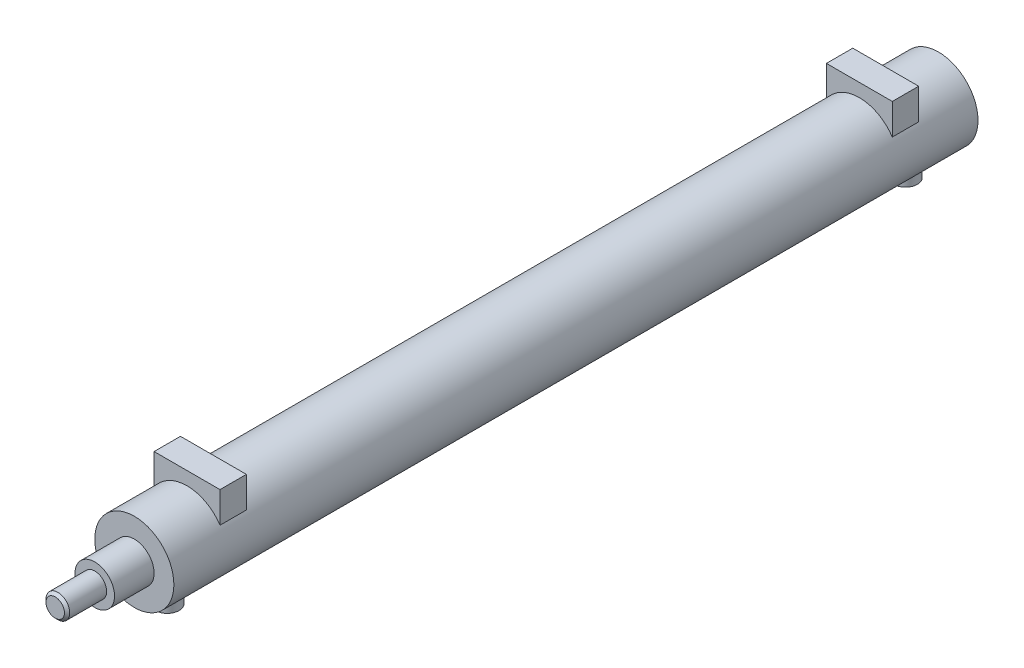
ISO-10303-21;
HEADER;
FILE_DESCRIPTION(('STEP AP214'),'2;1');
FILE_NAME('part.step','',(''),(''),'','','');
FILE_SCHEMA(('AUTOMOTIVE_DESIGN { 1 0 10303 214 1 1 1 1 }'));
ENDSEC;
DATA;
#1=APPLICATION_CONTEXT('core data for automotive mechanical design processes');
#2=APPLICATION_PROTOCOL_DEFINITION('international standard','automotive_design',2000,#1);
#3=PRODUCT_CONTEXT('',#1,'mechanical');
#4=PRODUCT('Part','Part','',(#3));
#5=PRODUCT_RELATED_PRODUCT_CATEGORY('part','',(#4));
#6=PRODUCT_DEFINITION_FORMATION('','',#4);
#7=PRODUCT_DEFINITION_CONTEXT('part definition',#1,'design');
#8=PRODUCT_DEFINITION('design','',#6,#7);
#9=PRODUCT_DEFINITION_SHAPE('','',#8);
#10=(LENGTH_UNIT() NAMED_UNIT(*) SI_UNIT(.MILLI.,.METRE.));
#11=(NAMED_UNIT(*) PLANE_ANGLE_UNIT() SI_UNIT($,.RADIAN.));
#12=(NAMED_UNIT(*) SI_UNIT($,.STERADIAN.) SOLID_ANGLE_UNIT());
#13=UNCERTAINTY_MEASURE_WITH_UNIT(LENGTH_MEASURE(1.E-05),#10,'distance_accuracy_value','');
#14=(GEOMETRIC_REPRESENTATION_CONTEXT(3) GLOBAL_UNCERTAINTY_ASSIGNED_CONTEXT((#13)) GLOBAL_UNIT_ASSIGNED_CONTEXT((#10,
#11,#12)) REPRESENTATION_CONTEXT('',''));
#15=CARTESIAN_POINT('',(0.,0.,0.));
#16=DIRECTION('',(0.,0.,1.));
#17=DIRECTION('',(1.,0.,0.));
#18=AXIS2_PLACEMENT_3D('',#15,#16,#17);
#19=CARTESIAN_POINT('',(0.,0.,305.));
#20=DIRECTION('',(0.,0.,-1.));
#21=DIRECTION('',(-1.,0.,0.));
#22=AXIS2_PLACEMENT_3D('',#19,#20,#21);
#23=CYLINDRICAL_SURFACE('',#22,30.);
#24=CARTESIAN_POINT('',(0.,-30.,289.));
#25=CARTESIAN_POINT('',(0.246875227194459,-29.9999996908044,288.999999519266));
#26=CARTESIAN_POINT('',(0.493758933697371,-29.9969453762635,288.989833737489));
#27=CARTESIAN_POINT('',(0.985713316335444,-29.984811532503,288.949262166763));
#28=CARTESIAN_POINT('',(1.23078390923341,-29.975731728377,288.918855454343));
#29=CARTESIAN_POINT('',(1.71734028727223,-29.9517958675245,288.838074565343));
#30=CARTESIAN_POINT('',(1.95882582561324,-29.9369394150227,288.787699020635));
#31=CARTESIAN_POINT('',(2.43656882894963,-29.9018482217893,288.667400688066));
#32=CARTESIAN_POINT('',(2.67282432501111,-29.8816114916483,288.597470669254));
#33=CARTESIAN_POINT('',(3.13795593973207,-29.836349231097,288.438809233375));
#34=CARTESIAN_POINT('',(3.36684511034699,-29.8113327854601,288.350113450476));
#35=CARTESIAN_POINT('',(3.81629034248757,-29.7571367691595,288.154509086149));
#36=CARTESIAN_POINT('',(4.0368432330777,-29.7279556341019,288.047593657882));
#37=CARTESIAN_POINT('',(4.4680640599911,-29.6662069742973,287.816408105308));
#38=CARTESIAN_POINT('',(4.67873511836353,-29.6336405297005,287.692143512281));
#39=CARTESIAN_POINT('',(5.08907702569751,-29.5659358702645,287.427044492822));
#40=CARTESIAN_POINT('',(5.2887427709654,-29.5307964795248,287.286202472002));
#41=CARTESIAN_POINT('',(5.68079175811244,-29.4579256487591,286.985074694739));
#42=CARTESIAN_POINT('',(5.87285312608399,-29.4201506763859,286.824380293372));
#43=CARTESIAN_POINT('',(6.24276841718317,-29.3438835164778,286.487708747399));
#44=CARTESIAN_POINT('',(6.42062827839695,-29.3053916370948,286.311738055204));
#45=CARTESIAN_POINT('',(6.76121495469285,-29.2286925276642,285.945464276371));
#46=CARTESIAN_POINT('',(6.92393310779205,-29.1904854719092,285.755153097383));
#47=CARTESIAN_POINT('',(7.23301044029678,-29.1154400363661,285.361543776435));
#48=CARTESIAN_POINT('',(7.37937568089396,-29.0786011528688,285.158250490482));
#49=CARTESIAN_POINT('',(7.65798662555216,-29.0064894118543,284.735068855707));
#50=CARTESIAN_POINT('',(7.78983133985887,-28.9712718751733,284.514906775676));
#51=CARTESIAN_POINT('',(8.03438843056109,-28.904405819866,284.063791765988));
#52=CARTESIAN_POINT('',(8.14710828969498,-28.8727559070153,283.832843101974));
#53=CARTESIAN_POINT('',(8.35256518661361,-28.813991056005,283.361653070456));
#54=CARTESIAN_POINT('',(8.44530186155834,-28.7868762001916,283.121411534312));
#55=CARTESIAN_POINT('',(8.60997610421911,-28.7380531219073,282.633368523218));
#56=CARTESIAN_POINT('',(8.68191441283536,-28.7163447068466,282.385567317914));
#57=CARTESIAN_POINT('',(8.80260979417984,-28.6795734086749,281.891284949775));
#58=CARTESIAN_POINT('',(8.85195939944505,-28.6643415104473,281.644961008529));
#59=CARTESIAN_POINT('',(8.92991899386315,-28.640150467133,281.148746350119));
#60=CARTESIAN_POINT('',(8.958529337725,-28.6311912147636,280.898855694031));
#61=CARTESIAN_POINT('',(8.99473123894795,-28.6198387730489,280.397460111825));
#62=CARTESIAN_POINT('',(9.00232721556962,-28.6174442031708,280.145955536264));
#63=CARTESIAN_POINT('',(8.99643811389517,-28.6192961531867,279.643220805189));
#64=CARTESIAN_POINT('',(8.98295349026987,-28.6235425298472,279.391990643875));
#65=CARTESIAN_POINT('',(8.93590903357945,-28.6382629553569,278.900833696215));
#66=CARTESIAN_POINT('',(8.90309651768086,-28.6485050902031,278.660827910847));
#67=CARTESIAN_POINT('',(8.81829693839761,-28.6747206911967,278.184459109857));
#68=CARTESIAN_POINT('',(8.7663030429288,-28.6906961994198,277.94809742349));
#69=CARTESIAN_POINT('',(8.64359525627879,-28.7279021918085,277.480749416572));
#70=CARTESIAN_POINT('',(8.5728840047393,-28.7491319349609,277.24976234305));
#71=CARTESIAN_POINT('',(8.41330748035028,-28.7962353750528,276.794626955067));
#72=CARTESIAN_POINT('',(8.32444120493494,-28.8221093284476,276.570479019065));
#73=CARTESIAN_POINT('',(8.12789997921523,-28.8781547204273,276.127433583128));
#74=CARTESIAN_POINT('',(8.01998497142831,-28.9083799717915,275.908649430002));
#75=CARTESIAN_POINT('',(7.78698416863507,-28.9720115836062,275.480907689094));
#76=CARTESIAN_POINT('',(7.66189790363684,-29.0054180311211,275.27195037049));
#77=CARTESIAN_POINT('',(7.39538391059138,-29.074511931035,274.865075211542));
#78=CARTESIAN_POINT('',(7.25395309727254,-29.1101998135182,274.667159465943));
#79=CARTESIAN_POINT('',(6.95567501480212,-29.1829084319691,274.283565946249));
#80=CARTESIAN_POINT('',(6.79882730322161,-29.2199292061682,274.097888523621));
#81=CARTESIAN_POINT('',(6.46380880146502,-29.2959022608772,273.732370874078));
#82=CARTESIAN_POINT('',(6.28502066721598,-29.3348705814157,273.553099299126));
#83=CARTESIAN_POINT('',(5.9129033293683,-29.4121348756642,273.210184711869));
#84=CARTESIAN_POINT('',(5.71957407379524,-29.4504308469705,273.04654175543));
#85=CARTESIAN_POINT('',(5.31957947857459,-29.5253022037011,272.735965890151));
#86=CARTESIAN_POINT('',(5.11291276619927,-29.5618774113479,272.589034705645));
#87=CARTESIAN_POINT('',(4.68759447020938,-29.6322950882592,272.31295026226));
#88=CARTESIAN_POINT('',(4.46894340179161,-29.6661376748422,272.183796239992));
#89=CARTESIAN_POINT('',(4.01951930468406,-29.7303774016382,271.943396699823));
#90=CARTESIAN_POINT('',(3.78867237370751,-29.7607488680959,271.832282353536));
#91=CARTESIAN_POINT('',(3.31796148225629,-29.8168958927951,271.630010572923));
#92=CARTESIAN_POINT('',(3.07810121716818,-29.8426733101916,271.538845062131));
#93=CARTESIAN_POINT('',(2.59100646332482,-29.8889030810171,271.377208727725));
#94=CARTESIAN_POINT('',(2.34377211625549,-29.9093555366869,271.306737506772));
#95=CARTESIAN_POINT('',(1.8437841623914,-29.9443358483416,271.187138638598));
#96=CARTESIAN_POINT('',(1.59103075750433,-29.9588639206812,271.138010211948));
#97=CARTESIAN_POINT('',(1.09110687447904,-29.9811579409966,271.062938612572));
#98=CARTESIAN_POINT('',(0.844061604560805,-29.9891478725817,271.036226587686));
#99=CARTESIAN_POINT('',(0.348488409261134,-29.9989994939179,271.003321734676));
#100=CARTESIAN_POINT('',(0.099960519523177,-30.0008613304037,270.99712841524));
#101=CARTESIAN_POINT('',(-0.396693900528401,-29.9984049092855,271.005317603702));
#102=CARTESIAN_POINT('',(-0.644820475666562,-29.9940873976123,271.019697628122));
#103=CARTESIAN_POINT('',(-1.13885569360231,-29.9793942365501,271.06889541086));
#104=CARTESIAN_POINT('',(-1.38476435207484,-29.9690186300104,271.103713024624));
#105=CARTESIAN_POINT('',(-1.86699068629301,-29.9428009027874,271.192442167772));
#106=CARTESIAN_POINT('',(-2.10339917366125,-29.9270889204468,271.245899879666));
#107=CARTESIAN_POINT('',(-2.5708534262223,-29.8905620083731,271.371598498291));
#108=CARTESIAN_POINT('',(-2.80189723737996,-29.8697452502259,271.443846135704));
#109=CARTESIAN_POINT('',(-3.25694777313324,-29.8235575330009,271.606510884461));
#110=CARTESIAN_POINT('',(-3.4809564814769,-29.7981878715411,271.696922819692));
#111=CARTESIAN_POINT('',(-3.9206735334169,-29.7435275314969,271.895278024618));
#112=CARTESIAN_POINT('',(-4.13637865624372,-29.7142353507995,272.003228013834));
#113=CARTESIAN_POINT('',(-4.5628802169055,-29.6517727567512,272.238506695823));
#114=CARTESIAN_POINT('',(-4.7734538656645,-29.6185293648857,272.366219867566));
#115=CARTESIAN_POINT('',(-5.18324820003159,-29.5495708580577,272.638311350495));
#116=CARTESIAN_POINT('',(-5.38246373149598,-29.513854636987,272.782697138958));
#117=CARTESIAN_POINT('',(-5.76824209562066,-29.4408886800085,273.087130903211));
#118=CARTESIAN_POINT('',(-5.95480494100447,-29.4036389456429,273.24717886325));
#119=CARTESIAN_POINT('',(-6.31416336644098,-29.3285704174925,273.581928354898));
#120=CARTESIAN_POINT('',(-6.48695868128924,-29.2907516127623,273.756630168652));
#121=CARTESIAN_POINT('',(-6.82378475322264,-29.2141554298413,274.126266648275));
#122=CARTESIAN_POINT('',(-6.98726403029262,-29.1753935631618,274.321707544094));
#123=CARTESIAN_POINT('',(-7.29714192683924,-29.0994358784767,274.725861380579));
#124=CARTESIAN_POINT('',(-7.44354675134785,-29.0622394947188,274.934569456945));
#125=CARTESIAN_POINT('',(-7.71836315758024,-28.9904649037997,275.364065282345));
#126=CARTESIAN_POINT('',(-7.84676762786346,-28.9558877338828,275.584857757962));
#127=CARTESIAN_POINT('',(-8.08449235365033,-28.8904168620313,276.036899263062));
#128=CARTESIAN_POINT('',(-8.19382047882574,-28.8595216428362,276.26814393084));
#129=CARTESIAN_POINT('',(-8.39212213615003,-28.8024806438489,276.738537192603));
#130=CARTESIAN_POINT('',(-8.48118472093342,-28.7763141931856,276.977645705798));
#131=CARTESIAN_POINT('',(-8.63880815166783,-28.7293885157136,277.463051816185));
#132=CARTESIAN_POINT('',(-8.70736898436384,-28.7086292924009,277.709349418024));
#133=CARTESIAN_POINT('',(-8.82333878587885,-28.6731995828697,278.207234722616));
#134=CARTESIAN_POINT('',(-8.8707538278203,-28.6585273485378,278.458820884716));
#135=CARTESIAN_POINT('',(-8.94399853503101,-28.6357533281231,278.965407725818));
#136=CARTESIAN_POINT('',(-8.96982902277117,-28.6276512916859,279.22040827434));
#137=CARTESIAN_POINT('',(-8.99902686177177,-28.6184858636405,279.721134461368));
#138=CARTESIAN_POINT('',(-9.00328608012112,-28.6171430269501,279.966803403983));
#139=CARTESIAN_POINT('',(-8.99170957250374,-28.6207826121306,280.457615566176));
#140=CARTESIAN_POINT('',(-8.97587443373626,-28.6257648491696,280.702758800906));
#141=CARTESIAN_POINT('',(-8.92425831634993,-28.6418983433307,281.190716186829));
#142=CARTESIAN_POINT('',(-8.88847824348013,-28.6530493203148,281.433530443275));
#143=CARTESIAN_POINT('',(-8.79729759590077,-28.6811754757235,281.915101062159));
#144=CARTESIAN_POINT('',(-8.74189693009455,-28.6981506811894,282.153857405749));
#145=CARTESIAN_POINT('',(-8.61278136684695,-28.7371619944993,282.622663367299));
#146=CARTESIAN_POINT('',(-8.53930707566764,-28.7591313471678,282.852784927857));
#147=CARTESIAN_POINT('',(-8.37426393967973,-28.8076222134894,283.306039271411));
#148=CARTESIAN_POINT('',(-8.28268862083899,-28.8341453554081,283.529169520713));
#149=CARTESIAN_POINT('',(-8.08215610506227,-28.890995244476,283.966953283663));
#150=CARTESIAN_POINT('',(-7.97319984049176,-28.9213217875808,284.181607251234));
#151=CARTESIAN_POINT('',(-7.73866416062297,-28.9849587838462,284.601178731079));
#152=CARTESIAN_POINT('',(-7.61308375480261,-29.0182694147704,284.806095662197));
#153=CARTESIAN_POINT('',(-7.3412648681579,-29.088248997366,285.212264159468));
#154=CARTESIAN_POINT('',(-7.19444058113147,-29.1249960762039,285.413110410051));
#155=CARTESIAN_POINT('',(-6.88480486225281,-29.1997400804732,285.801828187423));
#156=CARTESIAN_POINT('',(-6.72199309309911,-29.237737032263,285.989699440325));
#157=CARTESIAN_POINT('',(-6.38137449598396,-29.3139645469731,286.35136039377));
#158=CARTESIAN_POINT('',(-6.20356384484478,-29.3521951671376,286.525146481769));
#159=CARTESIAN_POINT('',(-5.83408763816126,-29.4278605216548,286.857489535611));
#160=CARTESIAN_POINT('',(-5.64242232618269,-29.465295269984,287.016046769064));
#161=CARTESIAN_POINT('',(-5.24055724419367,-29.5394569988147,287.321345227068));
#162=CARTESIAN_POINT('',(-5.02997746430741,-29.5761305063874,287.467599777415));
#163=CARTESIAN_POINT('',(-4.59683195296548,-29.6465386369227,287.741757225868));
#164=CARTESIAN_POINT('',(-4.37427060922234,-29.6802743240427,287.869666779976));
#165=CARTESIAN_POINT('',(-3.91863702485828,-29.7438595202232,288.10618008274));
#166=CARTESIAN_POINT('',(-3.685566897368,-29.7737098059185,288.214787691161));
#167=CARTESIAN_POINT('',(-3.21051695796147,-29.8286729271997,288.411818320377));
#168=CARTESIAN_POINT('',(-2.96853800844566,-29.853786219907,288.500243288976));
#169=CARTESIAN_POINT('',(-2.50382115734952,-29.8961424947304,288.647760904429));
#170=CARTESIAN_POINT('',(-2.2818074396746,-29.9139410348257,288.708983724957));
#171=CARTESIAN_POINT('',(-1.83334279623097,-29.9447721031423,288.814301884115));
#172=CARTESIAN_POINT('',(-1.60689045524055,-29.9578030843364,288.858391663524));
#173=CARTESIAN_POINT('',(-1.15106718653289,-29.97877731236,288.929066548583));
#174=CARTESIAN_POINT('',(-0.921696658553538,-29.9867212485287,288.955654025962));
#175=CARTESIAN_POINT('',(-0.461552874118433,-29.9973318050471,288.991117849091));
#176=CARTESIAN_POINT('',(-0.230780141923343,-30.0000002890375,289.000000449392));
#177=CARTESIAN_POINT('',(0.,-30.,289.));
#178=B_SPLINE_CURVE_WITH_KNOTS('',3,(#24,#25,#26,#27,#28,#29,#30,#31,#32,#33,#34,#35,#36,#37,
#38,#39,#40,#41,#42,#43,#44,#45,#46,#47,#48,#49,#50,#51,#52,#53,#54,#55,#56,#57,#58,#59,#60,#61,
#62,#63,#64,#65,#66,#67,#68,#69,#70,#71,#72,#73,#74,#75,#76,#77,#78,#79,#80,#81,#82,#83,#84,#85,
#86,#87,#88,#89,#90,#91,#92,#93,#94,#95,#96,#97,#98,#99,#100,#101,#102,#103,#104,#105,#106,#107,
#108,#109,#110,#111,#112,#113,#114,#115,#116,#117,#118,#119,#120,#121,#122,#123,#124,#125,#126,
#127,#128,#129,#130,#131,#132,#133,#134,#135,#136,#137,#138,#139,#140,#141,#142,#143,#144,#145,
#146,#147,#148,#149,#150,#151,#152,#153,#154,#155,#156,#157,#158,#159,#160,#161,#162,#163,#164,
#165,#166,#167,#168,#169,#170,#171,#172,#173,#174,#175,#176,#177),.UNSPECIFIED.,.T.,.F.,(4,2,2,
2,2,2,2,2,2,2,2,2,2,2,2,2,2,2,2,2,2,2,2,2,2,2,2,2,2,2,2,2,2,2,2,2,2,2,2,2,2,2,2,2,2,2,2,2,2,2,2,
2,2,2,2,2,2,2,2,2,2,2,2,2,2,2,2,2,2,2,2,2,2,2,2,2,4),(0.,0.740413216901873,1.4808602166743,
2.22135795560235,2.96212988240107,3.70150758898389,4.44116376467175,5.18058465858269,
5.92034562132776,6.67923780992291,7.43781100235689,8.19681551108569,8.95553775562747,
9.73166741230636,10.5074926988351,11.2833320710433,12.0591438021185,12.8132385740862,
13.5673204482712,14.3212437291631,15.0751507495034,15.8016616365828,16.5284315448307,
17.2550990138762,17.9818066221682,18.7184283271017,19.4550701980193,20.1918513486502,
20.9286536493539,21.6962623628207,22.4638738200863,23.2315644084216,23.9992220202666,
24.7722331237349,25.5449306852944,26.3176134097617,27.0902679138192,27.8351912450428,
28.5800967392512,29.32491232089,30.0697226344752,30.797537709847,31.5256138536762,
32.2534828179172,32.9816313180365,33.7263192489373,34.4713424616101,35.2163649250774,
35.9614017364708,36.7336800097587,37.5056767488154,38.2779776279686,39.0499591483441,
39.818479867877,40.5870010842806,41.3553014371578,42.1235725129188,42.8598040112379,
43.5960139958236,44.3321905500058,45.0683705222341,45.7952353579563,46.5223606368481,
47.2494469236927,47.9765765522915,48.7301889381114,49.483817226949,50.237638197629,
50.9914459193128,51.7674951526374,52.5432621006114,53.3188737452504,54.0944105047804,
54.7866663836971,55.4791466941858,56.1715331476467,56.8636749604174),.UNSPECIFIED.);
#179=CARTESIAN_POINT('',(0.,-30.,289.));
#180=VERTEX_POINT('',#179);
#181=EDGE_CURVE('E196',#180,#180,#178,.T.);
#182=ORIENTED_EDGE('',*,*,#181,.T.);
#183=EDGE_LOOP('',(#182));
#184=FACE_BOUND('',#183,.T.);
#185=CARTESIAN_POINT('',(0.,0.,265.));
#186=DIRECTION('',(0.,0.,1.));
#187=DIRECTION('',(1.,0.,0.));
#188=AXIS2_PLACEMENT_3D('',#185,#186,#187);
#189=CIRCLE('',#188,30.);
#190=CARTESIAN_POINT('',(25.,16.5831239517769,265.));
#191=VERTEX_POINT('',#190);
#192=CARTESIAN_POINT('',(-25.,16.5831239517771,265.));
#193=VERTEX_POINT('',#192);
#194=EDGE_CURVE('E182',#191,#193,#189,.T.);
#195=ORIENTED_EDGE('',*,*,#194,.T.);
#196=DIRECTION('',(0.,0.,-1.));
#197=VECTOR('',#196,1.);
#198=CARTESIAN_POINT('',(-25.,16.5831239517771,305.));
#199=LINE('',#198,#197);
#200=CARTESIAN_POINT('',(-25.,16.5831239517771,245.));
#201=VERTEX_POINT('',#200);
#202=EDGE_CURVE('E107',#193,#201,#199,.T.);
#203=ORIENTED_EDGE('',*,*,#202,.T.);
#204=CARTESIAN_POINT('',(0.,0.,245.));
#205=DIRECTION('',(0.,0.,-1.));
#206=DIRECTION('',(-1.,0.,0.));
#207=AXIS2_PLACEMENT_3D('',#204,#205,#206);
#208=CIRCLE('',#207,30.);
#209=CARTESIAN_POINT('',(25.,16.5831239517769,245.));
#210=VERTEX_POINT('',#209);
#211=EDGE_CURVE('E176',#201,#210,#208,.T.);
#212=ORIENTED_EDGE('',*,*,#211,.T.);
#213=DIRECTION('',(0.,0.,-1.));
#214=VECTOR('',#213,1.);
#215=CARTESIAN_POINT('',(25.,16.5831239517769,305.));
#216=LINE('',#215,#214);
#217=EDGE_CURVE('E179',#210,#191,#216,.F.);
#218=ORIENTED_EDGE('',*,*,#217,.T.);
#219=EDGE_LOOP('',(#195,#203,#212,#218));
#220=FACE_BOUND('',#219,.T.);
#221=CARTESIAN_POINT('',(0.,0.,-305.));
#222=DIRECTION('',(0.,0.,1.));
#223=DIRECTION('',(1.,0.,0.));
#224=AXIS2_PLACEMENT_3D('',#221,#222,#223);
#225=CIRCLE('',#224,30.);
#226=CARTESIAN_POINT('',(30.,0.,-305.));
#227=VERTEX_POINT('',#226);
#228=EDGE_CURVE('E159',#227,#227,#225,.T.);
#229=ORIENTED_EDGE('',*,*,#228,.T.);
#230=EDGE_LOOP('',(#229));
#231=FACE_BOUND('',#230,.T.);
#232=CARTESIAN_POINT('',(0.,0.,305.));
#233=DIRECTION('',(0.,0.,1.));
#234=DIRECTION('',(1.,0.,0.));
#235=AXIS2_PLACEMENT_3D('',#232,#233,#234);
#236=CIRCLE('',#235,30.);
#237=CARTESIAN_POINT('',(30.,0.,305.));
#238=VERTEX_POINT('',#237);
#239=EDGE_CURVE('E162',#238,#238,#236,.T.);
#240=ORIENTED_EDGE('',*,*,#239,.F.);
#241=EDGE_LOOP('',(#240));
#242=FACE_BOUND('',#241,.T.);
#243=DIRECTION('',(0.,0.,-1.));
#244=VECTOR('',#243,1.);
#245=CARTESIAN_POINT('',(-25.,16.5831239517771,305.));
#246=LINE('',#245,#244);
#247=CARTESIAN_POINT('',(-25.,16.5831239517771,-265.));
#248=VERTEX_POINT('',#247);
#249=CARTESIAN_POINT('',(-25.,16.5831239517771,-245.));
#250=VERTEX_POINT('',#249);
#251=EDGE_CURVE('E174',#248,#250,#246,.F.);
#252=ORIENTED_EDGE('',*,*,#251,.F.);
#253=CARTESIAN_POINT('',(0.,0.,-265.));
#254=DIRECTION('',(0.,0.,1.));
#255=DIRECTION('',(1.,0.,0.));
#256=AXIS2_PLACEMENT_3D('',#253,#254,#255);
#257=CIRCLE('',#256,30.);
#258=CARTESIAN_POINT('',(25.,16.5831239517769,-265.));
#259=VERTEX_POINT('',#258);
#260=EDGE_CURVE('E165',#259,#248,#257,.T.);
#261=ORIENTED_EDGE('',*,*,#260,.F.);
#262=DIRECTION('',(0.,0.,-1.));
#263=VECTOR('',#262,1.);
#264=CARTESIAN_POINT('',(25.,16.5831239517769,305.));
#265=LINE('',#264,#263);
#266=CARTESIAN_POINT('',(25.,16.5831239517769,-245.));
#267=VERTEX_POINT('',#266);
#268=EDGE_CURVE('E170',#267,#259,#265,.T.);
#269=ORIENTED_EDGE('',*,*,#268,.F.);
#270=CARTESIAN_POINT('',(0.,0.,-245.));
#271=DIRECTION('',(0.,0.,-1.));
#272=DIRECTION('',(-1.,0.,0.));
#273=AXIS2_PLACEMENT_3D('',#270,#271,#272);
#274=CIRCLE('',#273,30.);
#275=EDGE_CURVE('E58',#250,#267,#274,.T.);
#276=ORIENTED_EDGE('',*,*,#275,.F.);
#277=EDGE_LOOP('',(#252,#261,#269,#276));
#278=FACE_BOUND('',#277,.T.);
#279=CARTESIAN_POINT('',(0.,-30.,-271.));
#280=CARTESIAN_POINT('',(-0.246875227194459,-29.9999996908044,-271.000000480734));
#281=CARTESIAN_POINT('',(-0.493758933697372,-29.9969453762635,-271.01016626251));
#282=CARTESIAN_POINT('',(-0.985713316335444,-29.984811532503,-271.050737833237));
#283=CARTESIAN_POINT('',(-1.23078390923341,-29.975731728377,-271.081144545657));
#284=CARTESIAN_POINT('',(-1.71734028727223,-29.9517958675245,-271.161925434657));
#285=CARTESIAN_POINT('',(-1.95882582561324,-29.9369394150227,-271.212300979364));
#286=CARTESIAN_POINT('',(-2.43656882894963,-29.9018482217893,-271.332599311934));
#287=CARTESIAN_POINT('',(-2.67282432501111,-29.8816114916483,-271.402529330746));
#288=CARTESIAN_POINT('',(-3.13795593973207,-29.836349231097,-271.561190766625));
#289=CARTESIAN_POINT('',(-3.36684511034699,-29.8113327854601,-271.649886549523));
#290=CARTESIAN_POINT('',(-3.81629034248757,-29.7571367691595,-271.845490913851));
#291=CARTESIAN_POINT('',(-4.0368432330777,-29.7279556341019,-271.952406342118));
#292=CARTESIAN_POINT('',(-4.46806405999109,-29.6662069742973,-272.183591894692));
#293=CARTESIAN_POINT('',(-4.67873511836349,-29.6336405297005,-272.307856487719));
#294=CARTESIAN_POINT('',(-5.08907702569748,-29.5659358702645,-272.572955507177));
#295=CARTESIAN_POINT('',(-5.28874277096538,-29.5307964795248,-272.713797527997));
#296=CARTESIAN_POINT('',(-5.68079175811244,-29.4579256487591,-273.014925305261));
#297=CARTESIAN_POINT('',(-5.87285312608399,-29.4201506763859,-273.175619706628));
#298=CARTESIAN_POINT('',(-6.24276841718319,-29.3438835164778,-273.512291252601));
#299=CARTESIAN_POINT('',(-6.42062827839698,-29.3053916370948,-273.688261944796));
#300=CARTESIAN_POINT('',(-6.76121495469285,-29.2286925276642,-274.054535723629));
#301=CARTESIAN_POINT('',(-6.92393310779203,-29.1904854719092,-274.244846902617));
#302=CARTESIAN_POINT('',(-7.23301044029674,-29.1154400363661,-274.638456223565));
#303=CARTESIAN_POINT('',(-7.37937568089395,-29.0786011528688,-274.841749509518));
#304=CARTESIAN_POINT('',(-7.65798662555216,-29.0064894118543,-275.264931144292));
#305=CARTESIAN_POINT('',(-7.78983133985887,-28.9712718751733,-275.485093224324));
#306=CARTESIAN_POINT('',(-8.03438843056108,-28.904405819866,-275.936208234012));
#307=CARTESIAN_POINT('',(-8.14710828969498,-28.8727559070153,-276.167156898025));
#308=CARTESIAN_POINT('',(-8.35256518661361,-28.813991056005,-276.638346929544));
#309=CARTESIAN_POINT('',(-8.44530186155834,-28.7868762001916,-276.878588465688));
#310=CARTESIAN_POINT('',(-8.6099761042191,-28.7380531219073,-277.366631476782));
#311=CARTESIAN_POINT('',(-8.68191441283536,-28.7163447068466,-277.614432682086));
#312=CARTESIAN_POINT('',(-8.80260979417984,-28.6795734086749,-278.108715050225));
#313=CARTESIAN_POINT('',(-8.85195939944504,-28.6643415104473,-278.35503899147));
#314=CARTESIAN_POINT('',(-8.92991899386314,-28.640150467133,-278.851253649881));
#315=CARTESIAN_POINT('',(-8.958529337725,-28.6311912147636,-279.101144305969));
#316=CARTESIAN_POINT('',(-8.99473123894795,-28.6198387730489,-279.602539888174));
#317=CARTESIAN_POINT('',(-9.00232721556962,-28.6174442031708,-279.854044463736));
#318=CARTESIAN_POINT('',(-8.99643811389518,-28.6192961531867,-280.356779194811));
#319=CARTESIAN_POINT('',(-8.98295349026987,-28.6235425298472,-280.608009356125));
#320=CARTESIAN_POINT('',(-8.93590903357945,-28.6382629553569,-281.099166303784));
#321=CARTESIAN_POINT('',(-8.90309651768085,-28.6485050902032,-281.339172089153));
#322=CARTESIAN_POINT('',(-8.8182969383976,-28.6747206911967,-281.815540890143));
#323=CARTESIAN_POINT('',(-8.76630304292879,-28.6906961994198,-282.051902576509));
#324=CARTESIAN_POINT('',(-8.64359525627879,-28.7279021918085,-282.519250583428));
#325=CARTESIAN_POINT('',(-8.5728840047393,-28.7491319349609,-282.75023765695));
#326=CARTESIAN_POINT('',(-8.41330748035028,-28.7962353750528,-283.205373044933));
#327=CARTESIAN_POINT('',(-8.32444120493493,-28.8221093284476,-283.429520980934));
#328=CARTESIAN_POINT('',(-8.12789997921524,-28.8781547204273,-283.872566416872));
#329=CARTESIAN_POINT('',(-8.01998497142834,-28.9083799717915,-284.091350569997));
#330=CARTESIAN_POINT('',(-7.7869841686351,-28.9720115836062,-284.519092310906));
#331=CARTESIAN_POINT('',(-7.66189790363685,-29.0054180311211,-284.728049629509));
#332=CARTESIAN_POINT('',(-7.39538391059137,-29.074511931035,-285.134924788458));
#333=CARTESIAN_POINT('',(-7.25395309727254,-29.1101998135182,-285.332840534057));
#334=CARTESIAN_POINT('',(-6.95567501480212,-29.1829084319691,-285.71643405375));
#335=CARTESIAN_POINT('',(-6.7988273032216,-29.2199292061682,-285.902111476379));
#336=CARTESIAN_POINT('',(-6.46380880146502,-29.2959022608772,-286.267629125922));
#337=CARTESIAN_POINT('',(-6.28502066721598,-29.3348705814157,-286.446900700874));
#338=CARTESIAN_POINT('',(-5.91290332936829,-29.4121348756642,-286.789815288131));
#339=CARTESIAN_POINT('',(-5.71957407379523,-29.4504308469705,-286.95345824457));
#340=CARTESIAN_POINT('',(-5.31957947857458,-29.5253022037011,-287.264034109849));
#341=CARTESIAN_POINT('',(-5.11291276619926,-29.5618774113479,-287.410965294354));
#342=CARTESIAN_POINT('',(-4.68759447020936,-29.6322950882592,-287.68704973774));
#343=CARTESIAN_POINT('',(-4.46894340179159,-29.6661376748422,-287.816203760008));
#344=CARTESIAN_POINT('',(-4.01951930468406,-29.7303774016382,-288.056603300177));
#345=CARTESIAN_POINT('',(-3.78867237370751,-29.7607488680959,-288.167717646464));
#346=CARTESIAN_POINT('',(-3.31796148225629,-29.8168958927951,-288.369989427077));
#347=CARTESIAN_POINT('',(-3.07810121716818,-29.8426733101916,-288.461154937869));
#348=CARTESIAN_POINT('',(-2.59100646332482,-29.8889030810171,-288.622791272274));
#349=CARTESIAN_POINT('',(-2.34377211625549,-29.9093555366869,-288.693262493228));
#350=CARTESIAN_POINT('',(-1.8437841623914,-29.9443358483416,-288.812861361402));
#351=CARTESIAN_POINT('',(-1.59103075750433,-29.9588639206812,-288.861989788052));
#352=CARTESIAN_POINT('',(-1.09110687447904,-29.9811579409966,-288.937061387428));
#353=CARTESIAN_POINT('',(-0.844061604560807,-29.9891478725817,-288.963773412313));
#354=CARTESIAN_POINT('',(-0.348488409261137,-29.9989994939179,-288.996678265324));
#355=CARTESIAN_POINT('',(-0.0999605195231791,-30.0008613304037,-289.00287158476));
#356=CARTESIAN_POINT('',(0.396693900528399,-29.9984049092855,-288.994682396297));
#357=CARTESIAN_POINT('',(0.644820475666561,-29.9940873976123,-288.980302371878));
#358=CARTESIAN_POINT('',(1.13885569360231,-29.9793942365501,-288.93110458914));
#359=CARTESIAN_POINT('',(1.38476435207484,-29.9690186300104,-288.896286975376));
#360=CARTESIAN_POINT('',(1.86699068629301,-29.9428009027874,-288.807557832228));
#361=CARTESIAN_POINT('',(2.10339917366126,-29.9270889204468,-288.754100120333));
#362=CARTESIAN_POINT('',(2.57085342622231,-29.8905620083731,-288.628401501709));
#363=CARTESIAN_POINT('',(2.80189723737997,-29.8697452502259,-288.556153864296));
#364=CARTESIAN_POINT('',(3.25694777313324,-29.8235575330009,-288.393489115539));
#365=CARTESIAN_POINT('',(3.4809564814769,-29.7981878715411,-288.303077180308));
#366=CARTESIAN_POINT('',(3.9206735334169,-29.7435275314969,-288.104721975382));
#367=CARTESIAN_POINT('',(4.13637865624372,-29.7142353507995,-287.996771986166));
#368=CARTESIAN_POINT('',(4.5628802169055,-29.6517727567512,-287.761493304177));
#369=CARTESIAN_POINT('',(4.7734538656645,-29.6185293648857,-287.633780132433));
#370=CARTESIAN_POINT('',(5.18324820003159,-29.5495708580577,-287.361688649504));
#371=CARTESIAN_POINT('',(5.38246373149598,-29.513854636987,-287.217302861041));
#372=CARTESIAN_POINT('',(5.76824209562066,-29.4408886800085,-286.912869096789));
#373=CARTESIAN_POINT('',(5.95480494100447,-29.4036389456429,-286.75282113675));
#374=CARTESIAN_POINT('',(6.31416336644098,-29.3285704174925,-286.418071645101));
#375=CARTESIAN_POINT('',(6.48695868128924,-29.2907516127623,-286.243369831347));
#376=CARTESIAN_POINT('',(6.82378475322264,-29.2141554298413,-285.873733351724));
#377=CARTESIAN_POINT('',(6.98726403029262,-29.1753935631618,-285.678292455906));
#378=CARTESIAN_POINT('',(7.29714192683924,-29.0994358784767,-285.274138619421));
#379=CARTESIAN_POINT('',(7.44354675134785,-29.0622394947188,-285.065430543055));
#380=CARTESIAN_POINT('',(7.71836315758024,-28.9904649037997,-284.635934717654));
#381=CARTESIAN_POINT('',(7.84676762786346,-28.9558877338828,-284.415142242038));
#382=CARTESIAN_POINT('',(8.08449235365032,-28.8904168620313,-283.963100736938));
#383=CARTESIAN_POINT('',(8.19382047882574,-28.8595216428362,-283.73185606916));
#384=CARTESIAN_POINT('',(8.39212213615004,-28.8024806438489,-283.261462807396));
#385=CARTESIAN_POINT('',(8.48118472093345,-28.7763141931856,-283.022354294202));
#386=CARTESIAN_POINT('',(8.63880815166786,-28.7293885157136,-282.536948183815));
#387=CARTESIAN_POINT('',(8.70736898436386,-28.7086292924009,-282.290650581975));
#388=CARTESIAN_POINT('',(8.82333878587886,-28.6731995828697,-281.792765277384));
#389=CARTESIAN_POINT('',(8.87075382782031,-28.6585273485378,-281.541179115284));
#390=CARTESIAN_POINT('',(8.94399853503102,-28.6357533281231,-281.034592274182));
#391=CARTESIAN_POINT('',(8.96982902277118,-28.6276512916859,-280.77959172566));
#392=CARTESIAN_POINT('',(8.99902686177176,-28.6184858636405,-280.278865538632));
#393=CARTESIAN_POINT('',(9.00328608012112,-28.6171430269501,-280.033196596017));
#394=CARTESIAN_POINT('',(8.99170957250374,-28.6207826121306,-279.542384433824));
#395=CARTESIAN_POINT('',(8.97587443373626,-28.6257648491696,-279.297241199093));
#396=CARTESIAN_POINT('',(8.92425831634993,-28.6418983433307,-278.809283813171));
#397=CARTESIAN_POINT('',(8.88847824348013,-28.6530493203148,-278.566469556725));
#398=CARTESIAN_POINT('',(8.79729759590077,-28.6811754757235,-278.084898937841));
#399=CARTESIAN_POINT('',(8.74189693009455,-28.6981506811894,-277.84614259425));
#400=CARTESIAN_POINT('',(8.61278136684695,-28.7371619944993,-277.3773366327));
#401=CARTESIAN_POINT('',(8.53930707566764,-28.7591313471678,-277.147215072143));
#402=CARTESIAN_POINT('',(8.37426393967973,-28.8076222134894,-276.693960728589));
#403=CARTESIAN_POINT('',(8.28268862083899,-28.8341453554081,-276.470830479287));
#404=CARTESIAN_POINT('',(8.08215610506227,-28.890995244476,-276.033046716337));
#405=CARTESIAN_POINT('',(7.97319984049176,-28.9213217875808,-275.818392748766));
#406=CARTESIAN_POINT('',(7.73866416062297,-28.9849587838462,-275.398821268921));
#407=CARTESIAN_POINT('',(7.61308375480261,-29.0182694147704,-275.193904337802));
#408=CARTESIAN_POINT('',(7.3412648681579,-29.088248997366,-274.787735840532));
#409=CARTESIAN_POINT('',(7.19444058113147,-29.1249960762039,-274.586889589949));
#410=CARTESIAN_POINT('',(6.88480486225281,-29.1997400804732,-274.198171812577));
#411=CARTESIAN_POINT('',(6.72199309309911,-29.237737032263,-274.010300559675));
#412=CARTESIAN_POINT('',(6.38137449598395,-29.3139645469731,-273.64863960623));
#413=CARTESIAN_POINT('',(6.20356384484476,-29.3521951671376,-273.474853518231));
#414=CARTESIAN_POINT('',(5.83408763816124,-29.4278605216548,-273.142510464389));
#415=CARTESIAN_POINT('',(5.64242232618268,-29.465295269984,-272.983953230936));
#416=CARTESIAN_POINT('',(5.24055724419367,-29.5394569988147,-272.678654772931));
#417=CARTESIAN_POINT('',(5.02997746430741,-29.5761305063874,-272.532400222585));
#418=CARTESIAN_POINT('',(4.59683195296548,-29.6465386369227,-272.258242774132));
#419=CARTESIAN_POINT('',(4.37427060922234,-29.6802743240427,-272.130333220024));
#420=CARTESIAN_POINT('',(3.91863702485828,-29.7438595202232,-271.89381991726));
#421=CARTESIAN_POINT('',(3.685566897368,-29.7737098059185,-271.785212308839));
#422=CARTESIAN_POINT('',(3.21051695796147,-29.8286729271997,-271.588181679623));
#423=CARTESIAN_POINT('',(2.96853800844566,-29.853786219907,-271.499756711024));
#424=CARTESIAN_POINT('',(2.50382115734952,-29.8961424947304,-271.352239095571));
#425=CARTESIAN_POINT('',(2.28180743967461,-29.9139410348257,-271.291016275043));
#426=CARTESIAN_POINT('',(1.83334279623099,-29.9447721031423,-271.185698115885));
#427=CARTESIAN_POINT('',(1.60689045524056,-29.9578030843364,-271.141608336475));
#428=CARTESIAN_POINT('',(1.1510671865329,-29.97877731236,-271.070933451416));
#429=CARTESIAN_POINT('',(0.921696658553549,-29.9867212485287,-271.044345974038));
#430=CARTESIAN_POINT('',(0.461552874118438,-29.9973318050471,-271.008882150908));
#431=CARTESIAN_POINT('',(0.230780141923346,-30.0000002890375,-270.999999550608));
#432=CARTESIAN_POINT('',(0.,-30.,-271.));
#433=B_SPLINE_CURVE_WITH_KNOTS('',3,(#279,#280,#281,#282,#283,#284,#285,#286,#287,#288,#289,
#290,#291,#292,#293,#294,#295,#296,#297,#298,#299,#300,#301,#302,#303,#304,#305,#306,#307,#308,
#309,#310,#311,#312,#313,#314,#315,#316,#317,#318,#319,#320,#321,#322,#323,#324,#325,#326,#327,
#328,#329,#330,#331,#332,#333,#334,#335,#336,#337,#338,#339,#340,#341,#342,#343,#344,#345,#346,
#347,#348,#349,#350,#351,#352,#353,#354,#355,#356,#357,#358,#359,#360,#361,#362,#363,#364,#365,
#366,#367,#368,#369,#370,#371,#372,#373,#374,#375,#376,#377,#378,#379,#380,#381,#382,#383,#384,
#385,#386,#387,#388,#389,#390,#391,#392,#393,#394,#395,#396,#397,#398,#399,#400,#401,#402,#403,
#404,#405,#406,#407,#408,#409,#410,#411,#412,#413,#414,#415,#416,#417,#418,#419,#420,#421,#422,
#423,#424,#425,#426,#427,#428,#429,#430,#431,#432),.UNSPECIFIED.,.T.,.F.,(4,2,2,2,2,2,2,2,2,2,2,
2,2,2,2,2,2,2,2,2,2,2,2,2,2,2,2,2,2,2,2,2,2,2,2,2,2,2,2,2,2,2,2,2,2,2,2,2,2,2,2,2,2,2,2,2,2,2,2,
2,2,2,2,2,2,2,2,2,2,2,2,2,2,2,2,2,4),(0.,0.740413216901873,1.4808602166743,2.22135795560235,
2.96212988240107,3.70150758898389,4.44116376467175,5.18058465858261,5.92034562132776,
6.67923780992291,7.43781100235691,8.19681551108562,8.95553775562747,9.73166741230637,
10.507492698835,11.2833320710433,12.0591438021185,12.8132385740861,13.5673204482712,
14.3212437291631,15.0751507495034,15.8016616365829,16.5284315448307,17.2550990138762,
17.9818066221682,18.7184283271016,19.4550701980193,20.1918513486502,20.9286536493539,
21.6962623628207,22.4638738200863,23.2315644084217,23.9992220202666,24.7722331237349,
25.5449306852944,26.3176134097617,27.0902679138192,27.8351912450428,28.5800967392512,
29.32491232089,30.0697226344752,30.797537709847,31.5256138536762,32.2534828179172,
32.9816313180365,33.7263192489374,34.4713424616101,35.2163649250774,35.9614017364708,
36.7336800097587,37.5056767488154,38.2779776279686,39.0499591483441,39.8184798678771,
40.5870010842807,41.3553014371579,42.1235725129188,42.8598040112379,43.5960139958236,
44.3321905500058,45.0683705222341,45.7952353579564,46.5223606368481,47.2494469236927,
47.9765765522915,48.7301889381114,49.483817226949,50.2376381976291,50.9914459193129,
51.7674951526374,52.5432621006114,53.3188737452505,54.0944105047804,54.7866663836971,
55.4791466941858,56.1715331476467,56.8636749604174),.UNSPECIFIED.);
#434=CARTESIAN_POINT('',(0.,-30.,-271.));
#435=VERTEX_POINT('',#434);
#436=EDGE_CURVE('E11',#435,#435,#433,.T.);
#437=ORIENTED_EDGE('',*,*,#436,.F.);
#438=EDGE_LOOP('',(#437));
#439=FACE_BOUND('',#438,.T.);
#440=ADVANCED_FACE('F32',(#184,#220,#231,#242,#278,#439),#23,.T.);
#441=CARTESIAN_POINT('',(0.,0.,335.));
#442=DIRECTION('',(0.,0.,1.));
#443=DIRECTION('',(1.,0.,0.));
#444=AXIS2_PLACEMENT_3D('',#441,#442,#443);
#445=PLANE('',#444);
#446=CARTESIAN_POINT('',(0.,0.,335.));
#447=DIRECTION('',(0.,0.,1.));
#448=DIRECTION('',(1.,0.,0.));
#449=AXIS2_PLACEMENT_3D('',#446,#447,#448);
#450=CIRCLE('',#449,15.);
#451=CARTESIAN_POINT('',(15.,0.,335.));
#452=VERTEX_POINT('',#451);
#453=EDGE_CURVE('E156',#452,#452,#450,.T.);
#454=ORIENTED_EDGE('',*,*,#453,.T.);
#455=EDGE_LOOP('',(#454));
#456=FACE_BOUND('',#455,.T.);
#457=CARTESIAN_POINT('',(0.,0.,335.));
#458=DIRECTION('',(0.,0.,1.));
#459=DIRECTION('',(1.,0.,0.));
#460=AXIS2_PLACEMENT_3D('',#457,#458,#459);
#461=CIRCLE('',#460,9.);
#462=CARTESIAN_POINT('',(9.,0.,335.));
#463=VERTEX_POINT('',#462);
#464=EDGE_CURVE('E121',#463,#463,#461,.T.);
#465=ORIENTED_EDGE('',*,*,#464,.F.);
#466=EDGE_LOOP('',(#465));
#467=FACE_BOUND('',#466,.T.);
#468=ADVANCED_FACE('F262',(#456,#467),#445,.T.);
#469=CARTESIAN_POINT('',(0.,0.,305.));
#470=DIRECTION('',(0.,0.,1.));
#471=DIRECTION('',(1.,0.,0.));
#472=AXIS2_PLACEMENT_3D('',#469,#470,#471);
#473=PLANE('',#472);
#474=ORIENTED_EDGE('',*,*,#239,.T.);
#475=EDGE_LOOP('',(#474));
#476=FACE_BOUND('',#475,.T.);
#477=CARTESIAN_POINT('',(0.,0.,305.));
#478=DIRECTION('',(0.,0.,1.));
#479=DIRECTION('',(1.,0.,0.));
#480=AXIS2_PLACEMENT_3D('',#477,#478,#479);
#481=CIRCLE('',#480,15.);
#482=CARTESIAN_POINT('',(15.,0.,305.));
#483=VERTEX_POINT('',#482);
#484=EDGE_CURVE('E155',#483,#483,#481,.T.);
#485=ORIENTED_EDGE('',*,*,#484,.F.);
#486=EDGE_LOOP('',(#485));
#487=FACE_BOUND('',#486,.T.);
#488=ADVANCED_FACE('F265',(#476,#487),#473,.T.);
#489=CARTESIAN_POINT('',(0.,0.,-305.));
#490=DIRECTION('',(0.,0.,1.));
#491=DIRECTION('',(1.,0.,0.));
#492=AXIS2_PLACEMENT_3D('',#489,#490,#491);
#493=PLANE('',#492);
#494=ORIENTED_EDGE('',*,*,#228,.F.);
#495=EDGE_LOOP('',(#494));
#496=FACE_BOUND('',#495,.T.);
#497=ADVANCED_FACE('F269',(#496),#493,.F.);
#498=CARTESIAN_POINT('',(0.,0.,335.));
#499=DIRECTION('',(0.,0.,-1.));
#500=DIRECTION('',(-1.,0.,0.));
#501=AXIS2_PLACEMENT_3D('',#498,#499,#500);
#502=CYLINDRICAL_SURFACE('',#501,15.);
#503=ORIENTED_EDGE('',*,*,#453,.F.);
#504=EDGE_LOOP('',(#503));
#505=FACE_BOUND('',#504,.T.);
#506=ORIENTED_EDGE('',*,*,#484,.T.);
#507=EDGE_LOOP('',(#506));
#508=FACE_BOUND('',#507,.T.);
#509=ADVANCED_FACE('F260',(#505,#508),#502,.T.);
#510=CARTESIAN_POINT('',(-25.,40.,-245.));
#511=DIRECTION('',(1.,0.,0.));
#512=DIRECTION('',(0.,0.,-1.));
#513=AXIS2_PLACEMENT_3D('',#510,#511,#512);
#514=PLANE('',#513);
#515=DIRECTION('',(0.,-1.,0.));
#516=VECTOR('',#515,1.);
#517=CARTESIAN_POINT('',(-25.,40.,-265.));
#518=LINE('',#517,#516);
#519=CARTESIAN_POINT('',(-25.,40.,-265.));
#520=VERTEX_POINT('',#519);
#521=EDGE_CURVE('E143',#520,#248,#518,.T.);
#522=ORIENTED_EDGE('',*,*,#521,.T.);
#523=ORIENTED_EDGE('',*,*,#251,.T.);
#524=DIRECTION('',(0.,-1.,0.));
#525=VECTOR('',#524,1.);
#526=CARTESIAN_POINT('',(-25.,40.,-245.));
#527=LINE('',#526,#525);
#528=CARTESIAN_POINT('',(-25.,40.,-245.));
#529=VERTEX_POINT('',#528);
#530=EDGE_CURVE('E152',#529,#250,#527,.T.);
#531=ORIENTED_EDGE('',*,*,#530,.F.);
#532=DIRECTION('',(0.,0.,1.));
#533=VECTOR('',#532,1.);
#534=CARTESIAN_POINT('',(-25.,40.,-245.));
#535=LINE('',#534,#533);
#536=EDGE_CURVE('E111',#520,#529,#535,.T.);
#537=ORIENTED_EDGE('',*,*,#536,.F.);
#538=EDGE_LOOP('',(#522,#523,#531,#537));
#539=FACE_BOUND('',#538,.T.);
#540=ADVANCED_FACE('F256',(#539),#514,.F.);
#541=CARTESIAN_POINT('',(25.,40.,-245.));
#542=DIRECTION('',(0.,0.,-1.));
#543=DIRECTION('',(-1.,0.,0.));
#544=AXIS2_PLACEMENT_3D('',#541,#542,#543);
#545=PLANE('',#544);
#546=ORIENTED_EDGE('',*,*,#530,.T.);
#547=ORIENTED_EDGE('',*,*,#275,.T.);
#548=DIRECTION('',(0.,-1.,0.));
#549=VECTOR('',#548,1.);
#550=CARTESIAN_POINT('',(25.,40.,-245.));
#551=LINE('',#550,#549);
#552=CARTESIAN_POINT('',(25.,40.,-245.));
#553=VERTEX_POINT('',#552);
#554=EDGE_CURVE('E149',#553,#267,#551,.T.);
#555=ORIENTED_EDGE('',*,*,#554,.F.);
#556=DIRECTION('',(1.,0.,0.));
#557=VECTOR('',#556,1.);
#558=CARTESIAN_POINT('',(25.,40.,-245.));
#559=LINE('',#558,#557);
#560=EDGE_CURVE('E137',#529,#553,#559,.T.);
#561=ORIENTED_EDGE('',*,*,#560,.F.);
#562=EDGE_LOOP('',(#546,#547,#555,#561));
#563=FACE_BOUND('',#562,.T.);
#564=ADVANCED_FACE('F252',(#563),#545,.F.);
#565=CARTESIAN_POINT('',(25.,40.,-245.));
#566=DIRECTION('',(-1.,0.,0.));
#567=DIRECTION('',(0.,0.,1.));
#568=AXIS2_PLACEMENT_3D('',#565,#566,#567);
#569=PLANE('',#568);
#570=ORIENTED_EDGE('',*,*,#554,.T.);
#571=ORIENTED_EDGE('',*,*,#268,.T.);
#572=DIRECTION('',(0.,-1.,0.));
#573=VECTOR('',#572,1.);
#574=CARTESIAN_POINT('',(25.,40.,-265.));
#575=LINE('',#574,#573);
#576=CARTESIAN_POINT('',(25.,40.,-265.));
#577=VERTEX_POINT('',#576);
#578=EDGE_CURVE('E146',#577,#259,#575,.T.);
#579=ORIENTED_EDGE('',*,*,#578,.F.);
#580=DIRECTION('',(0.,0.,-1.));
#581=VECTOR('',#580,1.);
#582=CARTESIAN_POINT('',(25.,40.,-245.));
#583=LINE('',#582,#581);
#584=EDGE_CURVE('E139',#553,#577,#583,.T.);
#585=ORIENTED_EDGE('',*,*,#584,.F.);
#586=EDGE_LOOP('',(#570,#571,#579,#585));
#587=FACE_BOUND('',#586,.T.);
#588=ADVANCED_FACE('F248',(#587),#569,.F.);
#589=CARTESIAN_POINT('',(25.,40.,-265.));
#590=DIRECTION('',(0.,0.,1.));
#591=DIRECTION('',(1.,0.,0.));
#592=AXIS2_PLACEMENT_3D('',#589,#590,#591);
#593=PLANE('',#592);
#594=ORIENTED_EDGE('',*,*,#578,.T.);
#595=ORIENTED_EDGE('',*,*,#260,.T.);
#596=ORIENTED_EDGE('',*,*,#521,.F.);
#597=DIRECTION('',(-1.,0.,0.));
#598=VECTOR('',#597,1.);
#599=CARTESIAN_POINT('',(25.,40.,-265.));
#600=LINE('',#599,#598);
#601=EDGE_CURVE('E141',#577,#520,#600,.T.);
#602=ORIENTED_EDGE('',*,*,#601,.F.);
#603=EDGE_LOOP('',(#594,#595,#596,#602));
#604=FACE_BOUND('',#603,.T.);
#605=ADVANCED_FACE('F244',(#604),#593,.F.);
#606=CARTESIAN_POINT('',(0.,40.,0.));
#607=DIRECTION('',(0.,1.,0.));
#608=DIRECTION('',(0.,0.,1.));
#609=AXIS2_PLACEMENT_3D('',#606,#607,#608);
#610=PLANE('',#609);
#611=ORIENTED_EDGE('',*,*,#536,.T.);
#612=ORIENTED_EDGE('',*,*,#560,.T.);
#613=ORIENTED_EDGE('',*,*,#584,.T.);
#614=ORIENTED_EDGE('',*,*,#601,.T.);
#615=EDGE_LOOP('',(#611,#612,#613,#614));
#616=FACE_BOUND('',#615,.T.);
#617=ADVANCED_FACE('F241',(#616),#610,.T.);
#618=CARTESIAN_POINT('',(-25.,40.,245.));
#619=DIRECTION('',(-1.,0.,0.));
#620=DIRECTION('',(0.,0.,1.));
#621=AXIS2_PLACEMENT_3D('',#618,#619,#620);
#622=PLANE('',#621);
#623=ORIENTED_EDGE('',*,*,#202,.F.);
#624=DIRECTION('',(0.,-1.,0.));
#625=VECTOR('',#624,1.);
#626=CARTESIAN_POINT('',(-25.,40.,265.));
#627=LINE('',#626,#625);
#628=CARTESIAN_POINT('',(-25.,40.,265.));
#629=VERTEX_POINT('',#628);
#630=EDGE_CURVE('E100',#629,#193,#627,.T.);
#631=ORIENTED_EDGE('',*,*,#630,.F.);
#632=DIRECTION('',(0.,0.,-1.));
#633=VECTOR('',#632,1.);
#634=CARTESIAN_POINT('',(-25.,40.,245.));
#635=LINE('',#634,#633);
#636=CARTESIAN_POINT('',(-25.,40.,245.));
#637=VERTEX_POINT('',#636);
#638=EDGE_CURVE('E104',#629,#637,#635,.T.);
#639=ORIENTED_EDGE('',*,*,#638,.T.);
#640=DIRECTION('',(0.,-1.,0.));
#641=VECTOR('',#640,1.);
#642=CARTESIAN_POINT('',(-25.,40.,245.));
#643=LINE('',#642,#641);
#644=EDGE_CURVE('E131',#637,#201,#643,.T.);
#645=ORIENTED_EDGE('',*,*,#644,.T.);
#646=EDGE_LOOP('',(#623,#631,#639,#645));
#647=FACE_BOUND('',#646,.T.);
#648=ADVANCED_FACE('F102',(#647),#622,.T.);
#649=CARTESIAN_POINT('',(25.,40.,265.));
#650=DIRECTION('',(0.,0.,1.));
#651=DIRECTION('',(1.,0.,0.));
#652=AXIS2_PLACEMENT_3D('',#649,#650,#651);
#653=PLANE('',#652);
#654=ORIENTED_EDGE('',*,*,#194,.F.);
#655=DIRECTION('',(0.,-1.,0.));
#656=VECTOR('',#655,1.);
#657=CARTESIAN_POINT('',(25.,40.,265.));
#658=LINE('',#657,#656);
#659=CARTESIAN_POINT('',(25.,40.,265.));
#660=VERTEX_POINT('',#659);
#661=EDGE_CURVE('E112',#660,#191,#658,.T.);
#662=ORIENTED_EDGE('',*,*,#661,.F.);
#663=DIRECTION('',(-1.,0.,0.));
#664=VECTOR('',#663,1.);
#665=CARTESIAN_POINT('',(25.,40.,265.));
#666=LINE('',#665,#664);
#667=EDGE_CURVE('E118',#660,#629,#666,.T.);
#668=ORIENTED_EDGE('',*,*,#667,.T.);
#669=ORIENTED_EDGE('',*,*,#630,.T.);
#670=EDGE_LOOP('',(#654,#662,#668,#669));
#671=FACE_BOUND('',#670,.T.);
#672=ADVANCED_FACE('F123',(#671),#653,.T.);
#673=CARTESIAN_POINT('',(25.,40.,245.));
#674=DIRECTION('',(1.,0.,0.));
#675=DIRECTION('',(0.,0.,-1.));
#676=AXIS2_PLACEMENT_3D('',#673,#674,#675);
#677=PLANE('',#676);
#678=ORIENTED_EDGE('',*,*,#217,.F.);
#679=DIRECTION('',(0.,-1.,0.));
#680=VECTOR('',#679,1.);
#681=CARTESIAN_POINT('',(25.,40.,245.));
#682=LINE('',#681,#680);
#683=CARTESIAN_POINT('',(25.,40.,245.));
#684=VERTEX_POINT('',#683);
#685=EDGE_CURVE('E50',#684,#210,#682,.T.);
#686=ORIENTED_EDGE('',*,*,#685,.F.);
#687=DIRECTION('',(0.,0.,1.));
#688=VECTOR('',#687,1.);
#689=CARTESIAN_POINT('',(25.,40.,245.));
#690=LINE('',#689,#688);
#691=EDGE_CURVE('E125',#684,#660,#690,.T.);
#692=ORIENTED_EDGE('',*,*,#691,.T.);
#693=ORIENTED_EDGE('',*,*,#661,.T.);
#694=EDGE_LOOP('',(#678,#686,#692,#693));
#695=FACE_BOUND('',#694,.T.);
#696=ADVANCED_FACE('F233',(#695),#677,.T.);
#697=CARTESIAN_POINT('',(25.,40.,245.));
#698=DIRECTION('',(0.,0.,-1.));
#699=DIRECTION('',(-1.,0.,0.));
#700=AXIS2_PLACEMENT_3D('',#697,#698,#699);
#701=PLANE('',#700);
#702=ORIENTED_EDGE('',*,*,#211,.F.);
#703=ORIENTED_EDGE('',*,*,#644,.F.);
#704=DIRECTION('',(1.,0.,0.));
#705=VECTOR('',#704,1.);
#706=CARTESIAN_POINT('',(25.,40.,245.));
#707=LINE('',#706,#705);
#708=EDGE_CURVE('E120',#637,#684,#707,.T.);
#709=ORIENTED_EDGE('',*,*,#708,.T.);
#710=ORIENTED_EDGE('',*,*,#685,.T.);
#711=EDGE_LOOP('',(#702,#703,#709,#710));
#712=FACE_BOUND('',#711,.T.);
#713=ADVANCED_FACE('F230',(#712),#701,.T.);
#714=CARTESIAN_POINT('',(0.,40.,0.));
#715=DIRECTION('',(0.,1.,0.));
#716=DIRECTION('',(0.,0.,-1.));
#717=AXIS2_PLACEMENT_3D('',#714,#715,#716);
#718=PLANE('',#717);
#719=ORIENTED_EDGE('',*,*,#638,.F.);
#720=ORIENTED_EDGE('',*,*,#667,.F.);
#721=ORIENTED_EDGE('',*,*,#691,.F.);
#722=ORIENTED_EDGE('',*,*,#708,.F.);
#723=EDGE_LOOP('',(#719,#720,#721,#722));
#724=FACE_BOUND('',#723,.T.);
#725=ADVANCED_FACE('F116',(#724),#718,.T.);
#726=CARTESIAN_POINT('',(0.,0.,365.));
#727=DIRECTION('',(0.,0.,-1.));
#728=DIRECTION('',(-1.,0.,0.));
#729=AXIS2_PLACEMENT_3D('',#726,#727,#728);
#730=CYLINDRICAL_SURFACE('',#729,9.);
#731=CARTESIAN_POINT('',(0.,0.,363.));
#732=DIRECTION('',(0.,0.,1.));
#733=DIRECTION('',(1.,0.,0.));
#734=AXIS2_PLACEMENT_3D('',#731,#732,#733);
#735=CIRCLE('',#734,9.);
#736=CARTESIAN_POINT('',(9.,0.,363.));
#737=VERTEX_POINT('',#736);
#738=EDGE_CURVE('E188',#737,#737,#735,.F.);
#739=ORIENTED_EDGE('',*,*,#738,.T.);
#740=EDGE_LOOP('',(#739));
#741=FACE_BOUND('',#740,.T.);
#742=ORIENTED_EDGE('',*,*,#464,.T.);
#743=EDGE_LOOP('',(#742));
#744=FACE_BOUND('',#743,.T.);
#745=ADVANCED_FACE('F223',(#741,#744),#730,.T.);
#746=CARTESIAN_POINT('',(0.,0.,365.));
#747=DIRECTION('',(0.,0.,1.));
#748=DIRECTION('',(1.,0.,0.));
#749=AXIS2_PLACEMENT_3D('',#746,#747,#748);
#750=PLANE('',#749);
#751=CARTESIAN_POINT('',(0.,0.,365.));
#752=DIRECTION('',(0.,0.,1.));
#753=DIRECTION('',(1.,0.,0.));
#754=AXIS2_PLACEMENT_3D('',#751,#752,#753);
#755=CIRCLE('',#754,7.00000000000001);
#756=CARTESIAN_POINT('',(7.00000000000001,0.,365.));
#757=VERTEX_POINT('',#756);
#758=EDGE_CURVE('E185',#757,#757,#755,.T.);
#759=ORIENTED_EDGE('',*,*,#758,.T.);
#760=EDGE_LOOP('',(#759));
#761=FACE_BOUND('',#760,.T.);
#762=ADVANCED_FACE('F220',(#761),#750,.T.);
#763=CARTESIAN_POINT('',(0.,0.,365.));
#764=DIRECTION('',(0.,0.,-1.));
#765=DIRECTION('',(-1.,0.,0.));
#766=AXIS2_PLACEMENT_3D('',#763,#764,#765);
#767=CONICAL_SURFACE('',#766,7.00000000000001,0.78539816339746);
#768=ORIENTED_EDGE('',*,*,#738,.F.);
#769=EDGE_LOOP('',(#768));
#770=FACE_BOUND('',#769,.T.);
#771=ORIENTED_EDGE('',*,*,#758,.F.);
#772=EDGE_LOOP('',(#771));
#773=FACE_BOUND('',#772,.T.);
#774=ADVANCED_FACE('F34',(#770,#773),#767,.T.);
#775=CARTESIAN_POINT('',(0.,-40.,280.));
#776=DIRECTION('',(0.,1.,0.));
#777=DIRECTION('',(0.,0.,1.));
#778=AXIS2_PLACEMENT_3D('',#775,#776,#777);
#779=CYLINDRICAL_SURFACE('',#778,9.);
#780=CARTESIAN_POINT('',(0.,-40.,280.));
#781=DIRECTION('',(0.,1.,0.));
#782=DIRECTION('',(0.,0.,1.));
#783=AXIS2_PLACEMENT_3D('',#780,#781,#782);
#784=CIRCLE('',#783,9.);
#785=CARTESIAN_POINT('',(0.,-40.,289.));
#786=VERTEX_POINT('',#785);
#787=EDGE_CURVE('E301',#786,#786,#784,.T.);
#788=ORIENTED_EDGE('',*,*,#787,.T.);
#789=EDGE_LOOP('',(#788));
#790=FACE_BOUND('',#789,.T.);
#791=ORIENTED_EDGE('',*,*,#181,.F.);
#792=EDGE_LOOP('',(#791));
#793=FACE_BOUND('',#792,.T.);
#794=ADVANCED_FACE('F208',(#790,#793),#779,.T.);
#795=CARTESIAN_POINT('',(0.,-40.,280.));
#796=DIRECTION('',(0.,1.,0.));
#797=DIRECTION('',(0.,0.,1.));
#798=AXIS2_PLACEMENT_3D('',#795,#796,#797);
#799=CYLINDRICAL_SURFACE('',#798,6.35);
#800=CARTESIAN_POINT('',(0.,-40.,280.));
#801=DIRECTION('',(0.,1.,0.));
#802=DIRECTION('',(0.,0.,1.));
#803=AXIS2_PLACEMENT_3D('',#800,#801,#802);
#804=CIRCLE('',#803,6.35);
#805=CARTESIAN_POINT('',(0.,-40.,286.35));
#806=VERTEX_POINT('',#805);
#807=EDGE_CURVE('E298',#806,#806,#804,.T.);
#808=ORIENTED_EDGE('',*,*,#807,.F.);
#809=EDGE_LOOP('',(#808));
#810=FACE_BOUND('',#809,.T.);
#811=CARTESIAN_POINT('',(0.,-30.,286.35));
#812=CARTESIAN_POINT('',(0.17629277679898,-30.0000020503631,286.350003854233));
#813=CARTESIAN_POINT('',(0.35253869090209,-29.9984434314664,286.34265673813));
#814=CARTESIAN_POINT('',(0.703807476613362,-29.992256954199,286.313335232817));
#815=CARTESIAN_POINT('',(0.87883015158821,-29.9876286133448,286.291358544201));
#816=CARTESIAN_POINT('',(1.22641648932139,-29.975426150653,286.232935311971));
#817=CARTESIAN_POINT('',(1.398978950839,-29.9678506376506,286.1964819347));
#818=CARTESIAN_POINT('',(1.74040631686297,-29.9499619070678,286.10938090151));
#819=CARTESIAN_POINT('',(1.90926983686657,-29.9396476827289,286.05872802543));
#820=CARTESIAN_POINT('',(2.24181967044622,-29.9165838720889,285.943707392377));
#821=CARTESIAN_POINT('',(2.40551289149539,-29.9038377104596,285.879358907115));
#822=CARTESIAN_POINT('',(2.72691224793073,-29.8762443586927,285.737362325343));
#823=CARTESIAN_POINT('',(2.88461614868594,-29.861396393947,285.659709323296));
#824=CARTESIAN_POINT('',(3.19285139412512,-29.8300132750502,285.491720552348));
#825=CARTESIAN_POINT('',(3.34338578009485,-29.8134788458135,285.401390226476));
#826=CARTESIAN_POINT('',(3.63641884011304,-29.779157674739,285.208620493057));
#827=CARTESIAN_POINT('',(3.77891448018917,-29.7613704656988,285.106176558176));
#828=CARTESIAN_POINT('',(4.05669804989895,-29.724789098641,284.888481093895));
#829=CARTESIAN_POINT('',(4.19186654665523,-29.7059847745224,284.773078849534));
#830=CARTESIAN_POINT('',(4.45208740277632,-29.6681009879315,284.531331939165));
#831=CARTESIAN_POINT('',(4.57713599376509,-29.6490214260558,284.404983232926));
#832=CARTESIAN_POINT('',(4.81618856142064,-29.6111292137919,284.142265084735));
#833=CARTESIAN_POINT('',(4.9301956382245,-29.592316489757,284.005898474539));
#834=CARTESIAN_POINT('',(5.14646656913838,-29.5554719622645,283.723970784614));
#835=CARTESIAN_POINT('',(5.24872607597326,-29.5374404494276,283.578406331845));
#836=CARTESIAN_POINT('',(5.44169297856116,-29.5025031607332,283.277608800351));
#837=CARTESIAN_POINT('',(5.53227535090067,-29.4856103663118,283.122293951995));
#838=CARTESIAN_POINT('',(5.70004454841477,-29.4536379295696,282.804339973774));
#839=CARTESIAN_POINT('',(5.77722633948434,-29.4385589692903,282.641698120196));
#840=CARTESIAN_POINT('',(5.91753072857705,-29.4106777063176,282.310337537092));
#841=CARTESIAN_POINT('',(5.98065975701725,-29.3978743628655,282.141621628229));
#842=CARTESIAN_POINT('',(6.09242120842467,-29.3749145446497,281.79928132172));
#843=CARTESIAN_POINT('',(6.14104838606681,-29.3647590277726,281.62565517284));
#844=CARTESIAN_POINT('',(6.26325899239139,-29.3390334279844,281.104413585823));
#845=CARTESIAN_POINT('',(6.31539449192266,-29.3277463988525,280.751163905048));
#846=CARTESIAN_POINT('',(6.3487301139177,-29.3205312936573,280.218946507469));
#847=CARTESIAN_POINT('',(6.35235650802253,-29.3197471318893,280.04107856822));
#848=CARTESIAN_POINT('',(6.34470324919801,-29.3214045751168,279.685656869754));
#849=CARTESIAN_POINT('',(6.33342338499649,-29.3238462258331,279.508103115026));
#850=CARTESIAN_POINT('',(6.2778985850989,-29.3358094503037,278.984000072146));
#851=CARTESIAN_POINT('',(6.2123555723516,-29.3498874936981,278.639571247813));
#852=CARTESIAN_POINT('',(6.02585973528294,-29.3887376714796,277.966892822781));
#853=CARTESIAN_POINT('',(5.90490398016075,-29.4135103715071,277.638644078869));
#854=CARTESIAN_POINT('',(5.6100781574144,-29.4711666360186,277.004566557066));
#855=CARTESIAN_POINT('',(5.43581805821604,-29.5041096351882,276.698924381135));
#856=CARTESIAN_POINT('',(5.03960566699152,-29.5743593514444,276.120859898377));
#857=CARTESIAN_POINT('',(4.81764726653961,-29.6116666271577,275.84844185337));
#858=CARTESIAN_POINT('',(4.32700874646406,-29.6873661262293,275.338765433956));
#859=CARTESIAN_POINT('',(4.05747498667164,-29.7257650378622,275.102328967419));
#860=CARTESIAN_POINT('',(3.48215441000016,-29.7986332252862,274.677886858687));
#861=CARTESIAN_POINT('',(3.17636701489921,-29.833102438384,274.489881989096));
#862=CARTESIAN_POINT('',(2.53625100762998,-29.8943284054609,274.167455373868));
#863=CARTESIAN_POINT('',(2.20186932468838,-29.9210703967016,274.033136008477));
#864=CARTESIAN_POINT('',(1.51459173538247,-29.9637183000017,273.822815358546));
#865=CARTESIAN_POINT('',(1.16169835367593,-29.9796256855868,273.746806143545));
#866=CARTESIAN_POINT('',(0.454470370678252,-29.9986040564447,273.656446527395));
#867=CARTESIAN_POINT('',(0.100285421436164,-30.0019089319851,273.640972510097));
#868=CARTESIAN_POINT('',(-0.605608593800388,-29.9959631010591,273.669084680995));
#869=CARTESIAN_POINT('',(-0.957317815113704,-29.9867131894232,273.712667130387));
#870=CARTESIAN_POINT('',(-1.64459156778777,-29.9568442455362,273.856722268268));
#871=CARTESIAN_POINT('',(-1.98028411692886,-29.9363420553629,273.956610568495));
#872=CARTESIAN_POINT('',(-2.6301523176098,-29.8862613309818,274.209798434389));
#873=CARTESIAN_POINT('',(-2.9443262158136,-29.8566820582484,274.36310234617));
#874=CARTESIAN_POINT('',(-3.5469197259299,-29.7911489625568,274.721140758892));
#875=CARTESIAN_POINT('',(-3.83493438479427,-29.7551144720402,274.926541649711));
#876=CARTESIAN_POINT('',(-4.37281450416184,-29.6808414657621,275.382077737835));
#877=CARTESIAN_POINT('',(-4.62267533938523,-29.6426026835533,275.632218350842));
#878=CARTESIAN_POINT('',(-5.08153914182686,-29.5674322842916,276.17520817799));
#879=CARTESIAN_POINT('',(-5.28976630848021,-29.5305344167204,276.468717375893));
#880=CARTESIAN_POINT('',(-5.65401842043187,-29.4629701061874,277.087403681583));
#881=CARTESIAN_POINT('',(-5.81004556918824,-29.4323034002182,277.412579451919));
#882=CARTESIAN_POINT('',(-6.00090780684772,-29.3937610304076,277.915837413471));
#883=CARTESIAN_POINT('',(-6.05725370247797,-29.3821742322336,278.085773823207));
#884=CARTESIAN_POINT('',(-6.15543280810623,-29.3617640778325,278.429934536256));
#885=CARTESIAN_POINT('',(-6.19727137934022,-29.3529397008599,278.604157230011));
#886=CARTESIAN_POINT('',(-6.26609125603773,-29.3383253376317,278.95563953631));
#887=CARTESIAN_POINT('',(-6.2930715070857,-29.3325355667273,279.132899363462));
#888=CARTESIAN_POINT('',(-6.33195209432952,-29.3241671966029,279.489138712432));
#889=CARTESIAN_POINT('',(-6.34385302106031,-29.3215884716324,279.668118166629));
#890=CARTESIAN_POINT('',(-6.35238587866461,-29.3197409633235,280.022800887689));
#891=CARTESIAN_POINT('',(-6.34932425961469,-29.3204057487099,280.198496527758));
#892=CARTESIAN_POINT('',(-6.32865931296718,-29.324873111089,280.548987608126));
#893=CARTESIAN_POINT('',(-6.31105627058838,-29.3286756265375,280.723783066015));
#894=CARTESIAN_POINT('',(-6.26144728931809,-29.3393067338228,281.071252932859));
#895=CARTESIAN_POINT('',(-6.22943895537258,-29.3461358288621,281.2439269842));
#896=CARTESIAN_POINT('',(-6.15128818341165,-29.3626164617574,281.585842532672));
#897=CARTESIAN_POINT('',(-6.10515077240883,-29.3722669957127,281.755085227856));
#898=CARTESIAN_POINT('',(-5.9992409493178,-29.394081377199,282.088572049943));
#899=CARTESIAN_POINT('',(-5.9395059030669,-29.4062383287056,282.252828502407));
#900=CARTESIAN_POINT('',(-5.80680249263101,-29.4327303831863,282.575653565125));
#901=CARTESIAN_POINT('',(-5.73383878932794,-29.4470647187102,282.734224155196));
#902=CARTESIAN_POINT('',(-5.5751577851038,-29.477519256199,283.044754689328));
#903=CARTESIAN_POINT('',(-5.48943508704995,-29.493640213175,283.196711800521));
#904=CARTESIAN_POINT('',(-5.30588990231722,-29.527211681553,283.492903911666));
#905=CARTESIAN_POINT('',(-5.20807152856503,-29.5446617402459,283.637141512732));
#906=CARTESIAN_POINT('',(-4.99896757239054,-29.5807672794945,283.919733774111));
#907=CARTESIAN_POINT('',(-4.88745808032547,-29.5994395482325,284.057920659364));
#908=CARTESIAN_POINT('',(-4.65333327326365,-29.6371479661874,284.324400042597));
#909=CARTESIAN_POINT('',(-4.53072184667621,-29.656183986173,284.452695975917));
#910=CARTESIAN_POINT('',(-4.27510628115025,-29.6941099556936,284.698664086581));
#911=CARTESIAN_POINT('',(-4.14209604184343,-29.712999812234,284.816329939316));
#912=CARTESIAN_POINT('',(-3.86668351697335,-29.750093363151,285.040112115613));
#913=CARTESIAN_POINT('',(-3.72428469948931,-29.7682973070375,285.14623266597));
#914=CARTESIAN_POINT('',(-3.42917949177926,-29.8037427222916,285.347477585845));
#915=CARTESIAN_POINT('',(-3.27636725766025,-29.820969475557,285.442449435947));
#916=CARTESIAN_POINT('',(-2.96315558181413,-29.8537182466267,285.61912164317));
#917=CARTESIAN_POINT('',(-2.80275896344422,-29.8692408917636,285.700826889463));
#918=CARTESIAN_POINT('',(-2.47553298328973,-29.8981384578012,285.850347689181));
#919=CARTESIAN_POINT('',(-2.30870734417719,-29.9115145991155,285.918171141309));
#920=CARTESIAN_POINT('',(-1.9697902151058,-29.9357448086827,286.039439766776));
#921=CARTESIAN_POINT('',(-1.79769970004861,-29.9465993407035,286.092887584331));
#922=CARTESIAN_POINT('',(-1.35929697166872,-29.97035478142,286.208819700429));
#923=CARTESIAN_POINT('',(-1.090276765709,-29.9814116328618,286.26168613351));
#924=CARTESIAN_POINT('',(-0.547466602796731,-29.9962325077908,286.332272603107));
#925=CARTESIAN_POINT('',(-0.27367683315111,-29.9999968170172,286.34999401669));
#926=CARTESIAN_POINT('',(0.,-30.,286.35));
#927=B_SPLINE_CURVE_WITH_KNOTS('',3,(#811,#812,#813,#814,#815,#816,#817,#818,#819,#820,#821,
#822,#823,#824,#825,#826,#827,#828,#829,#830,#831,#832,#833,#834,#835,#836,#837,#838,#839,#840,
#841,#842,#843,#844,#845,#846,#847,#848,#849,#850,#851,#852,#853,#854,#855,#856,#857,#858,#859,
#860,#861,#862,#863,#864,#865,#866,#867,#868,#869,#870,#871,#872,#873,#874,#875,#876,#877,#878,
#879,#880,#881,#882,#883,#884,#885,#886,#887,#888,#889,#890,#891,#892,#893,#894,#895,#896,#897,
#898,#899,#900,#901,#902,#903,#904,#905,#906,#907,#908,#909,#910,#911,#912,#913,#914,#915,#916,
#917,#918,#919,#920,#921,#922,#923,#924,#925,#926),.UNSPECIFIED.,.T.,.F.,(4,2,2,2,2,2,2,2,2,2,2,
2,2,2,2,2,2,2,2,2,2,2,2,2,2,2,2,2,2,2,2,2,2,2,2,2,2,2,2,2,2,2,2,2,2,2,2,2,2,2,2,2,2,2,2,2,2,4),
(0.,0.528637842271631,1.05735879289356,1.58632962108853,2.11549517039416,2.6439209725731,
3.17254203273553,3.70093681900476,4.22952971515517,4.76507412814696,5.30081705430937,
5.83640912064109,6.37219875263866,6.91331775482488,7.45463959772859,7.9957132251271,
8.53698232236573,9.6025185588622,10.1357136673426,10.6689163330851,11.7162252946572,
12.7635896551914,13.8188087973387,14.8741631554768,15.9508476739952,17.0275493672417,
18.1062946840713,19.1848932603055,20.2433738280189,21.3017873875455,22.3494129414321,
23.3971237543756,24.4589790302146,25.5209629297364,26.6011941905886,27.6813798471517,
28.2190645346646,28.7565503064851,29.2940742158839,29.8315770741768,30.3581179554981,
30.8846485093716,31.4112666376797,31.9376976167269,32.4626990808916,32.9875159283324,
33.5125554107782,34.037416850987,34.572431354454,35.1072591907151,35.6424031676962,
36.1773505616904,36.7189254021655,37.2603001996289,37.8013660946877,38.3423323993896,
39.1630217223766,39.9836788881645),.UNSPECIFIED.);
#928=CARTESIAN_POINT('',(0.,-30.,286.35));
#929=VERTEX_POINT('',#928);
#930=EDGE_CURVE('E43',#929,#929,#927,.T.);
#931=ORIENTED_EDGE('',*,*,#930,.T.);
#932=EDGE_LOOP('',(#931));
#933=FACE_BOUND('',#932,.T.);
#934=ADVANCED_FACE('F203',(#810,#933),#799,.F.);
#935=CARTESIAN_POINT('',(0.,-40.,280.));
#936=DIRECTION('',(0.,1.,0.));
#937=DIRECTION('',(0.,0.,1.));
#938=AXIS2_PLACEMENT_3D('',#935,#936,#937);
#939=PLANE('',#938);
#940=ORIENTED_EDGE('',*,*,#807,.T.);
#941=EDGE_LOOP('',(#940));
#942=FACE_BOUND('',#941,.T.);
#943=ORIENTED_EDGE('',*,*,#787,.F.);
#944=EDGE_LOOP('',(#943));
#945=FACE_BOUND('',#944,.T.);
#946=ADVANCED_FACE('F207',(#942,#945),#939,.F.);
#947=ORIENTED_EDGE('',*,*,#930,.F.);
#948=EDGE_LOOP('',(#947));
#949=FACE_BOUND('',#948,.T.);
#950=ADVANCED_FACE('F214',(#949),#23,.T.);
#951=CARTESIAN_POINT('',(0.,-40.,-280.));
#952=DIRECTION('',(0.,1.,0.));
#953=DIRECTION('',(0.,0.,1.));
#954=AXIS2_PLACEMENT_3D('',#951,#952,#953);
#955=CYLINDRICAL_SURFACE('',#954,9.);
#956=CARTESIAN_POINT('',(0.,-40.,-280.));
#957=DIRECTION('',(0.,-1.,0.));
#958=DIRECTION('',(0.,0.,-1.));
#959=AXIS2_PLACEMENT_3D('',#956,#957,#958);
#960=CIRCLE('',#959,9.);
#961=CARTESIAN_POINT('',(0.,-40.,-289.));
#962=VERTEX_POINT('',#961);
#963=EDGE_CURVE('E299',#962,#962,#960,.T.);
#964=ORIENTED_EDGE('',*,*,#963,.F.);
#965=EDGE_LOOP('',(#964));
#966=FACE_BOUND('',#965,.T.);
#967=ORIENTED_EDGE('',*,*,#436,.T.);
#968=EDGE_LOOP('',(#967));
#969=FACE_BOUND('',#968,.T.);
#970=ADVANCED_FACE('F210',(#966,#969),#955,.T.);
#971=CARTESIAN_POINT('',(0.,-40.,-280.));
#972=DIRECTION('',(0.,1.,0.));
#973=DIRECTION('',(0.,0.,1.));
#974=AXIS2_PLACEMENT_3D('',#971,#972,#973);
#975=CYLINDRICAL_SURFACE('',#974,6.35);
#976=CARTESIAN_POINT('',(0.,-40.,-280.));
#977=DIRECTION('',(0.,-1.,0.));
#978=DIRECTION('',(0.,0.,-1.));
#979=AXIS2_PLACEMENT_3D('',#976,#977,#978);
#980=CIRCLE('',#979,6.35);
#981=CARTESIAN_POINT('',(0.,-40.,-286.35));
#982=VERTEX_POINT('',#981);
#983=EDGE_CURVE('E304',#982,#982,#980,.T.);
#984=ORIENTED_EDGE('',*,*,#983,.T.);
#985=EDGE_LOOP('',(#984));
#986=FACE_BOUND('',#985,.T.);
#987=CARTESIAN_POINT('',(0.,-30.,-273.65));
#988=CARTESIAN_POINT('',(-0.17629277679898,-30.0000020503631,-273.649996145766));
#989=CARTESIAN_POINT('',(-0.35253869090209,-29.9984434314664,-273.657343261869));
#990=CARTESIAN_POINT('',(-0.703807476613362,-29.992256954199,-273.686664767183));
#991=CARTESIAN_POINT('',(-0.87883015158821,-29.9876286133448,-273.708641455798));
#992=CARTESIAN_POINT('',(-1.22641648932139,-29.975426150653,-273.767064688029));
#993=CARTESIAN_POINT('',(-1.398978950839,-29.9678506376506,-273.8035180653));
#994=CARTESIAN_POINT('',(-1.74040631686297,-29.9499619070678,-273.89061909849));
#995=CARTESIAN_POINT('',(-1.90926983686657,-29.9396476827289,-273.94127197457));
#996=CARTESIAN_POINT('',(-2.24181967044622,-29.9165838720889,-274.056292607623));
#997=CARTESIAN_POINT('',(-2.40551289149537,-29.9038377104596,-274.120641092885));
#998=CARTESIAN_POINT('',(-2.72691224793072,-29.8762443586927,-274.262637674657));
#999=CARTESIAN_POINT('',(-2.88461614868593,-29.861396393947,-274.340290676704));
#1000=CARTESIAN_POINT('',(-3.19285139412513,-29.8300132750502,-274.508279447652));
#1001=CARTESIAN_POINT('',(-3.34338578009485,-29.8134788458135,-274.598609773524));
#1002=CARTESIAN_POINT('',(-3.63641884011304,-29.779157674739,-274.791379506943));
#1003=CARTESIAN_POINT('',(-3.77891448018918,-29.7613704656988,-274.893823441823));
#1004=CARTESIAN_POINT('',(-4.05669804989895,-29.724789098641,-275.111518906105));
#1005=CARTESIAN_POINT('',(-4.19186654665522,-29.7059847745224,-275.226921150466));
#1006=CARTESIAN_POINT('',(-4.45208740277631,-29.6681009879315,-275.468668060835));
#1007=CARTESIAN_POINT('',(-4.57713599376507,-29.6490214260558,-275.595016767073));
#1008=CARTESIAN_POINT('',(-4.81618856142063,-29.6111292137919,-275.857734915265));
#1009=CARTESIAN_POINT('',(-4.93019563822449,-29.592316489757,-275.994101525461));
#1010=CARTESIAN_POINT('',(-5.14646656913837,-29.5554719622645,-276.276029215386));
#1011=CARTESIAN_POINT('',(-5.24872607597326,-29.5374404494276,-276.421593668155));
#1012=CARTESIAN_POINT('',(-5.44169297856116,-29.5025031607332,-276.722391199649));
#1013=CARTESIAN_POINT('',(-5.53227535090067,-29.4856103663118,-276.877706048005));
#1014=CARTESIAN_POINT('',(-5.70004454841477,-29.4536379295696,-277.195660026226));
#1015=CARTESIAN_POINT('',(-5.77722633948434,-29.4385589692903,-277.358301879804));
#1016=CARTESIAN_POINT('',(-5.91753072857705,-29.4106777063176,-277.689662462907));
#1017=CARTESIAN_POINT('',(-5.98065975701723,-29.3978743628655,-277.858378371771));
#1018=CARTESIAN_POINT('',(-6.09242120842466,-29.3749145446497,-278.20071867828));
#1019=CARTESIAN_POINT('',(-6.1410483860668,-29.3647590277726,-278.37434482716));
#1020=CARTESIAN_POINT('',(-6.26325899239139,-29.3390334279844,-278.895586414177));
#1021=CARTESIAN_POINT('',(-6.31539449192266,-29.3277463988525,-279.248836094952));
#1022=CARTESIAN_POINT('',(-6.3487301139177,-29.3205312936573,-279.781053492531));
#1023=CARTESIAN_POINT('',(-6.35235650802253,-29.3197471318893,-279.95892143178));
#1024=CARTESIAN_POINT('',(-6.34470324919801,-29.3214045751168,-280.314343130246));
#1025=CARTESIAN_POINT('',(-6.33342338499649,-29.3238462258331,-280.491896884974));
#1026=CARTESIAN_POINT('',(-6.2778985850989,-29.3358094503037,-281.015999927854));
#1027=CARTESIAN_POINT('',(-6.2123555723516,-29.3498874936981,-281.360428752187));
#1028=CARTESIAN_POINT('',(-6.02585973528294,-29.3887376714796,-282.033107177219));
#1029=CARTESIAN_POINT('',(-5.90490398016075,-29.4135103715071,-282.36135592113));
#1030=CARTESIAN_POINT('',(-5.61007815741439,-29.4711666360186,-282.995433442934));
#1031=CARTESIAN_POINT('',(-5.43581805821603,-29.5041096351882,-283.301075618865));
#1032=CARTESIAN_POINT('',(-5.0396056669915,-29.5743593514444,-283.879140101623));
#1033=CARTESIAN_POINT('',(-4.8176472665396,-29.6116666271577,-284.15155814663));
#1034=CARTESIAN_POINT('',(-4.32700874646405,-29.6873661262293,-284.661234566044));
#1035=CARTESIAN_POINT('',(-4.05747498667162,-29.7257650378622,-284.897671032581));
#1036=CARTESIAN_POINT('',(-3.48215441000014,-29.7986332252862,-285.322113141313));
#1037=CARTESIAN_POINT('',(-3.1763670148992,-29.833102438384,-285.510118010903));
#1038=CARTESIAN_POINT('',(-2.53625100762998,-29.8943284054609,-285.832544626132));
#1039=CARTESIAN_POINT('',(-2.20186932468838,-29.9210703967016,-285.966863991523));
#1040=CARTESIAN_POINT('',(-1.51459173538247,-29.9637183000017,-286.177184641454));
#1041=CARTESIAN_POINT('',(-1.16169835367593,-29.9796256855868,-286.253193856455));
#1042=CARTESIAN_POINT('',(-0.454470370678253,-29.9986040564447,-286.343553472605));
#1043=CARTESIAN_POINT('',(-0.100285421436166,-30.0019089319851,-286.359027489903));
#1044=CARTESIAN_POINT('',(0.605608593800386,-29.9959631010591,-286.330915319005));
#1045=CARTESIAN_POINT('',(0.957317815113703,-29.9867131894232,-286.287332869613));
#1046=CARTESIAN_POINT('',(1.64459156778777,-29.9568442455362,-286.143277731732));
#1047=CARTESIAN_POINT('',(1.98028411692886,-29.9363420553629,-286.043389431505));
#1048=CARTESIAN_POINT('',(2.6301523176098,-29.8862613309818,-285.790201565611));
#1049=CARTESIAN_POINT('',(2.9443262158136,-29.8566820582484,-285.63689765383));
#1050=CARTESIAN_POINT('',(3.5469197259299,-29.7911489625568,-285.278859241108));
#1051=CARTESIAN_POINT('',(3.83493438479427,-29.7551144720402,-285.073458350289));
#1052=CARTESIAN_POINT('',(4.37281450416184,-29.6808414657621,-284.617922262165));
#1053=CARTESIAN_POINT('',(4.62267533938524,-29.6426026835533,-284.367781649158));
#1054=CARTESIAN_POINT('',(5.08153914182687,-29.5674322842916,-283.82479182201));
#1055=CARTESIAN_POINT('',(5.28976630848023,-29.5305344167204,-283.531282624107));
#1056=CARTESIAN_POINT('',(5.65401842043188,-29.4629701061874,-282.912596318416));
#1057=CARTESIAN_POINT('',(5.81004556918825,-29.4323034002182,-282.587420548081));
#1058=CARTESIAN_POINT('',(6.00090780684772,-29.3937610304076,-282.084162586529));
#1059=CARTESIAN_POINT('',(6.05725370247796,-29.3821742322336,-281.914226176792));
#1060=CARTESIAN_POINT('',(6.15543280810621,-29.3617640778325,-281.570065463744));
#1061=CARTESIAN_POINT('',(6.1972713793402,-29.3529397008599,-281.395842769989));
#1062=CARTESIAN_POINT('',(6.26609125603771,-29.3383253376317,-281.04436046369));
#1063=CARTESIAN_POINT('',(6.29307150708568,-29.3325355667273,-280.867100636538));
#1064=CARTESIAN_POINT('',(6.33195209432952,-29.3241671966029,-280.510861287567));
#1065=CARTESIAN_POINT('',(6.3438530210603,-29.3215884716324,-280.33188183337));
#1066=CARTESIAN_POINT('',(6.35238587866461,-29.3197409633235,-279.977199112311));
#1067=CARTESIAN_POINT('',(6.34932425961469,-29.3204057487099,-279.801503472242));
#1068=CARTESIAN_POINT('',(6.32865931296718,-29.324873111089,-279.451012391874));
#1069=CARTESIAN_POINT('',(6.31105627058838,-29.3286756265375,-279.276216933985));
#1070=CARTESIAN_POINT('',(6.26144728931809,-29.3393067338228,-278.92874706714));
#1071=CARTESIAN_POINT('',(6.22943895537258,-29.3461358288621,-278.7560730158));
#1072=CARTESIAN_POINT('',(6.15128818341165,-29.3626164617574,-278.414157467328));
#1073=CARTESIAN_POINT('',(6.10515077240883,-29.3722669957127,-278.244914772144));
#1074=CARTESIAN_POINT('',(5.9992409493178,-29.394081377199,-277.911427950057));
#1075=CARTESIAN_POINT('',(5.9395059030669,-29.4062383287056,-277.747171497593));
#1076=CARTESIAN_POINT('',(5.80680249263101,-29.4327303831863,-277.424346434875));
#1077=CARTESIAN_POINT('',(5.73383878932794,-29.4470647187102,-277.265775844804));
#1078=CARTESIAN_POINT('',(5.5751577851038,-29.477519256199,-276.955245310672));
#1079=CARTESIAN_POINT('',(5.48943508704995,-29.493640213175,-276.803288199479));
#1080=CARTESIAN_POINT('',(5.30588990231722,-29.527211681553,-276.507096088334));
#1081=CARTESIAN_POINT('',(5.20807152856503,-29.5446617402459,-276.362858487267));
#1082=CARTESIAN_POINT('',(4.99896757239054,-29.5807672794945,-276.080266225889));
#1083=CARTESIAN_POINT('',(4.88745808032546,-29.5994395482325,-275.942079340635));
#1084=CARTESIAN_POINT('',(4.65333327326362,-29.6371479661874,-275.675599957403));
#1085=CARTESIAN_POINT('',(4.53072184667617,-29.656183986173,-275.547304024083));
#1086=CARTESIAN_POINT('',(4.27510628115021,-29.6941099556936,-275.301335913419));
#1087=CARTESIAN_POINT('',(4.1420960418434,-29.712999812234,-275.183670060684));
#1088=CARTESIAN_POINT('',(3.86668351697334,-29.750093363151,-274.959887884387));
#1089=CARTESIAN_POINT('',(3.72428469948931,-29.7682973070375,-274.85376733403));
#1090=CARTESIAN_POINT('',(3.42917949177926,-29.8037427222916,-274.652522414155));
#1091=CARTESIAN_POINT('',(3.27636725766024,-29.820969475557,-274.557550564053));
#1092=CARTESIAN_POINT('',(2.96315558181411,-29.8537182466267,-274.380878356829));
#1093=CARTESIAN_POINT('',(2.80275896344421,-29.8692408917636,-274.299173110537));
#1094=CARTESIAN_POINT('',(2.47553298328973,-29.8981384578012,-274.149652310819));
#1095=CARTESIAN_POINT('',(2.30870734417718,-29.9115145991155,-274.081828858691));
#1096=CARTESIAN_POINT('',(1.9697902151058,-29.9357448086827,-273.960560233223));
#1097=CARTESIAN_POINT('',(1.79769970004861,-29.9465993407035,-273.907112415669));
#1098=CARTESIAN_POINT('',(1.35929697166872,-29.97035478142,-273.791180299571));
#1099=CARTESIAN_POINT('',(1.090276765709,-29.9814116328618,-273.73831386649));
#1100=CARTESIAN_POINT('',(0.54746660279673,-29.9962325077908,-273.667727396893));
#1101=CARTESIAN_POINT('',(0.27367683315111,-29.9999968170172,-273.65000598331));
#1102=CARTESIAN_POINT('',(0.,-30.,-273.65));
#1103=B_SPLINE_CURVE_WITH_KNOTS('',3,(#987,#988,#989,#990,#991,#992,#993,#994,#995,#996,#997,
#998,#999,#1000,#1001,#1002,#1003,#1004,#1005,#1006,#1007,#1008,#1009,#1010,#1011,#1012,#1013,
#1014,#1015,#1016,#1017,#1018,#1019,#1020,#1021,#1022,#1023,#1024,#1025,#1026,#1027,#1028,#1029,
#1030,#1031,#1032,#1033,#1034,#1035,#1036,#1037,#1038,#1039,#1040,#1041,#1042,#1043,#1044,#1045,
#1046,#1047,#1048,#1049,#1050,#1051,#1052,#1053,#1054,#1055,#1056,#1057,#1058,#1059,#1060,#1061,
#1062,#1063,#1064,#1065,#1066,#1067,#1068,#1069,#1070,#1071,#1072,#1073,#1074,#1075,#1076,#1077,
#1078,#1079,#1080,#1081,#1082,#1083,#1084,#1085,#1086,#1087,#1088,#1089,#1090,#1091,#1092,#1093,
#1094,#1095,#1096,#1097,#1098,#1099,#1100,#1101,#1102),.UNSPECIFIED.,.T.,.F.,(4,2,2,2,2,2,2,2,2,
2,2,2,2,2,2,2,2,2,2,2,2,2,2,2,2,2,2,2,2,2,2,2,2,2,2,2,2,2,2,2,2,2,2,2,2,2,2,2,2,2,2,2,2,2,2,2,2,
4),(0.,0.528637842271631,1.05735879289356,1.58632962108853,2.11549517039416,2.64392097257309,
3.17254203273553,3.70093681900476,4.22952971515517,4.76507412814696,5.30081705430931,
5.83640912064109,6.37219875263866,6.91331775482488,7.45463959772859,7.99571322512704,
8.53698232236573,9.6025185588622,10.1357136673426,10.6689163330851,11.7162252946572,
12.7635896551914,13.8188087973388,14.8741631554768,15.9508476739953,17.0275493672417,
18.1062946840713,19.1848932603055,20.2433738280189,21.3017873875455,22.3494129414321,
23.3971237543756,24.4589790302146,25.5209629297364,26.6011941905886,27.6813798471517,
28.2190645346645,28.756550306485,29.2940742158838,29.8315770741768,30.3581179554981,
30.8846485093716,31.4112666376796,31.9376976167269,32.4626990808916,32.9875159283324,
33.5125554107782,34.037416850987,34.572431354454,35.1072591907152,35.6424031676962,
36.1773505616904,36.7189254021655,37.2603001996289,37.8013660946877,38.3423323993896,
39.1630217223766,39.9836788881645),.UNSPECIFIED.);
#1104=CARTESIAN_POINT('',(0.,-30.,-273.65));
#1105=VERTEX_POINT('',#1104);
#1106=EDGE_CURVE('E296',#1105,#1105,#1103,.T.);
#1107=ORIENTED_EDGE('',*,*,#1106,.F.);
#1108=EDGE_LOOP('',(#1107));
#1109=FACE_BOUND('',#1108,.T.);
#1110=ADVANCED_FACE('F292',(#986,#1109),#975,.F.);
#1111=CARTESIAN_POINT('',(0.,-40.,-280.));
#1112=DIRECTION('',(0.,1.,0.));
#1113=DIRECTION('',(0.,0.,-1.));
#1114=AXIS2_PLACEMENT_3D('',#1111,#1112,#1113);
#1115=PLANE('',#1114);
#1116=ORIENTED_EDGE('',*,*,#963,.T.);
#1117=EDGE_LOOP('',(#1116));
#1118=FACE_BOUND('',#1117,.T.);
#1119=ORIENTED_EDGE('',*,*,#983,.F.);
#1120=EDGE_LOOP('',(#1119));
#1121=FACE_BOUND('',#1120,.T.);
#1122=ADVANCED_FACE('F287',(#1118,#1121),#1115,.F.);
#1123=ORIENTED_EDGE('',*,*,#1106,.T.);
#1124=EDGE_LOOP('',(#1123));
#1125=FACE_BOUND('',#1124,.T.);
#1126=ADVANCED_FACE('F200',(#1125),#23,.T.);
#1127=CLOSED_SHELL('',(#440,#468,#488,#497,#509,#540,#564,#588,#605,#617,#648,#672,#696,#713,
#725,#745,#762,#774,#794,#934,#946,#950,#970,#1110,#1122,#1126));
#1128=MANIFOLD_SOLID_BREP('B2',#1127);
#1129=ADVANCED_BREP_SHAPE_REPRESENTATION('',(#18,#1128),#14);
#1130=SHAPE_DEFINITION_REPRESENTATION(#9,#1129);
ENDSEC;
END-ISO-10303-21;
